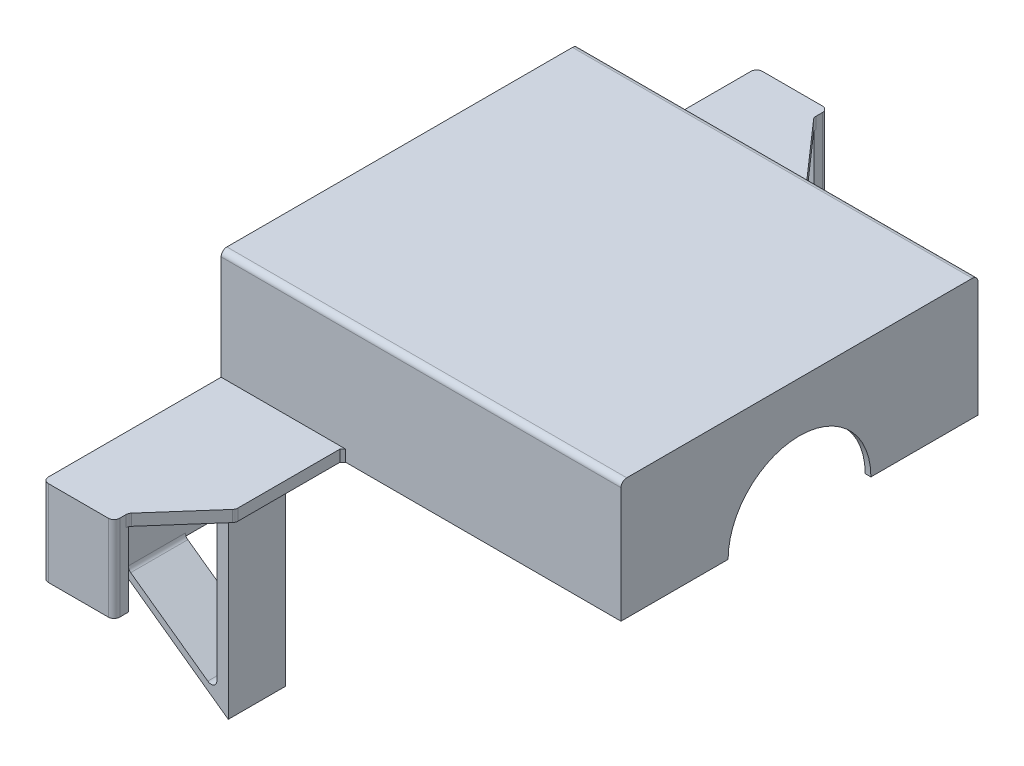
ISO-10303-21;
HEADER;
FILE_DESCRIPTION(('STEP AP214'),'2;1');
FILE_NAME('part.step','',(''),(''),'','','');
FILE_SCHEMA(('AUTOMOTIVE_DESIGN { 1 0 10303 214 1 1 1 1 }'));
ENDSEC;
DATA;
#1=APPLICATION_CONTEXT('core data for automotive mechanical design processes');
#2=APPLICATION_PROTOCOL_DEFINITION('international standard','automotive_design',2000,#1);
#3=PRODUCT_CONTEXT('',#1,'mechanical');
#4=PRODUCT('Part','Part','',(#3));
#5=PRODUCT_RELATED_PRODUCT_CATEGORY('part','',(#4));
#6=PRODUCT_DEFINITION_FORMATION('','',#4);
#7=PRODUCT_DEFINITION_CONTEXT('part definition',#1,'design');
#8=PRODUCT_DEFINITION('design','',#6,#7);
#9=PRODUCT_DEFINITION_SHAPE('','',#8);
#10=(LENGTH_UNIT() NAMED_UNIT(*) SI_UNIT(.MILLI.,.METRE.));
#11=(NAMED_UNIT(*) PLANE_ANGLE_UNIT() SI_UNIT($,.RADIAN.));
#12=(NAMED_UNIT(*) SI_UNIT($,.STERADIAN.) SOLID_ANGLE_UNIT());
#13=UNCERTAINTY_MEASURE_WITH_UNIT(LENGTH_MEASURE(1.E-05),#10,'distance_accuracy_value','');
#14=(GEOMETRIC_REPRESENTATION_CONTEXT(3) GLOBAL_UNCERTAINTY_ASSIGNED_CONTEXT((#13)) GLOBAL_UNIT_ASSIGNED_CONTEXT((#10,
#11,#12)) REPRESENTATION_CONTEXT('',''));
#15=CARTESIAN_POINT('',(0.,0.,0.));
#16=DIRECTION('',(0.,0.,1.));
#17=DIRECTION('',(1.,0.,0.));
#18=AXIS2_PLACEMENT_3D('',#15,#16,#17);
#19=CARTESIAN_POINT('',(0.,0.,0.));
#20=DIRECTION('',(0.,-1.,0.));
#21=DIRECTION('',(0.,0.,-1.));
#22=AXIS2_PLACEMENT_3D('',#19,#20,#21);
#23=PLANE('',#22);
#24=DIRECTION('',(1.,0.,0.));
#25=VECTOR('',#24,1.);
#26=CARTESIAN_POINT('',(-70.001,0.,-25.));
#27=LINE('',#26,#25);
#28=CARTESIAN_POINT('',(70.,0.,-25.));
#29=VERTEX_POINT('',#28);
#30=CARTESIAN_POINT('',(68.,0.,-25.));
#31=VERTEX_POINT('',#30);
#32=EDGE_CURVE('E404',#29,#31,#27,.F.);
#33=ORIENTED_EDGE('',*,*,#32,.T.);
#34=DIRECTION('',(0.,0.,-1.));
#35=VECTOR('',#34,1.);
#36=CARTESIAN_POINT('',(68.,0.,0.));
#37=LINE('',#36,#35);
#38=CARTESIAN_POINT('',(68.,0.,-60.5));
#39=VERTEX_POINT('',#38);
#40=EDGE_CURVE('E742',#31,#39,#37,.T.);
#41=ORIENTED_EDGE('',*,*,#40,.T.);
#42=DIRECTION('',(-1.,0.,0.));
#43=VECTOR('',#42,1.);
#44=CARTESIAN_POINT('',(0.,0.,-60.5));
#45=LINE('',#44,#43);
#46=CARTESIAN_POINT('',(-66.,0.,-60.5));
#47=VERTEX_POINT('',#46);
#48=EDGE_CURVE('E731',#39,#47,#45,.T.);
#49=ORIENTED_EDGE('',*,*,#48,.T.);
#50=DIRECTION('',(0.,0.,1.));
#51=VECTOR('',#50,1.);
#52=CARTESIAN_POINT('',(-66.,0.,0.));
#53=LINE('',#52,#51);
#54=CARTESIAN_POINT('',(-66.,0.,-99.0000000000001));
#55=VERTEX_POINT('',#54);
#56=EDGE_CURVE('E880',#55,#47,#53,.T.);
#57=ORIENTED_EDGE('',*,*,#56,.F.);
#58=DIRECTION('',(-1.,0.,0.));
#59=VECTOR('',#58,1.);
#60=CARTESIAN_POINT('',(-66.,0.,-99.0000000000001));
#61=LINE('',#60,#59);
#62=CARTESIAN_POINT('',(-70.,0.,-99.0000000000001));
#63=VERTEX_POINT('',#62);
#64=EDGE_CURVE('E657',#55,#63,#61,.T.);
#65=ORIENTED_EDGE('',*,*,#64,.T.);
#66=DIRECTION('',(0.,0.,1.));
#67=VECTOR('',#66,1.);
#68=CARTESIAN_POINT('',(-70.,0.,-62.5));
#69=LINE('',#68,#67);
#70=CARTESIAN_POINT('',(-70.,0.,-120.));
#71=VERTEX_POINT('',#70);
#72=EDGE_CURVE('E429',#71,#63,#69,.T.);
#73=ORIENTED_EDGE('',*,*,#72,.F.);
#74=DIRECTION('',(-1.,0.,0.));
#75=VECTOR('',#74,1.);
#76=CARTESIAN_POINT('',(-70.,0.,-120.));
#77=LINE('',#76,#75);
#78=CARTESIAN_POINT('',(-45.,0.,-120.));
#79=VERTEX_POINT('',#78);
#80=EDGE_CURVE('E677',#79,#71,#77,.T.);
#81=ORIENTED_EDGE('',*,*,#80,.F.);
#82=DIRECTION('',(0.,0.,1.));
#83=VECTOR('',#82,1.);
#84=CARTESIAN_POINT('',(-45.,0.,0.));
#85=LINE('',#84,#83);
#86=CARTESIAN_POINT('',(-45.,0.,-120.754695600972));
#87=VERTEX_POINT('',#86);
#88=EDGE_CURVE('E552',#87,#79,#85,.T.);
#89=ORIENTED_EDGE('',*,*,#88,.F.);
#90=CARTESIAN_POINT('',(-43.,0.,-120.754695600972));
#91=DIRECTION('',(0.,-1.,0.));
#92=DIRECTION('',(0.,0.,-1.));
#93=AXIS2_PLACEMENT_3D('',#90,#91,#92);
#94=CIRCLE('',#93,2.);
#95=CARTESIAN_POINT('',(-44.5014270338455,0.,-119.433439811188));
#96=VERTEX_POINT('',#95);
#97=EDGE_CURVE('E604',#87,#96,#94,.F.);
#98=ORIENTED_EDGE('',*,*,#97,.T.);
#99=DIRECTION('',(-0.660627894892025,0.,-0.750713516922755));
#100=VECTOR('',#99,1.);
#101=CARTESIAN_POINT('',(-45.,0.,-120.));
#102=LINE('',#101,#100);
#103=CARTESIAN_POINT('',(-27.8985729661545,0.,-100.566560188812));
#104=VERTEX_POINT('',#103);
#105=EDGE_CURVE('E693',#104,#96,#102,.T.);
#106=ORIENTED_EDGE('',*,*,#105,.F.);
#107=CARTESIAN_POINT('',(-29.4,0.,-99.2453043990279));
#108=DIRECTION('',(0.,-1.,0.));
#109=DIRECTION('',(0.,0.,-1.));
#110=AXIS2_PLACEMENT_3D('',#107,#108,#109);
#111=CIRCLE('',#110,2.);
#112=CARTESIAN_POINT('',(-27.4,0.,-99.2453043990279));
#113=VERTEX_POINT('',#112);
#114=EDGE_CURVE('E515',#104,#113,#111,.T.);
#115=ORIENTED_EDGE('',*,*,#114,.T.);
#116=DIRECTION('',(0.,0.,-1.));
#117=VECTOR('',#116,1.);
#118=CARTESIAN_POINT('',(-27.4,0.,-100.));
#119=LINE('',#118,#117);
#120=CARTESIAN_POINT('',(-27.4,0.,-63.5000000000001));
#121=VERTEX_POINT('',#120);
#122=EDGE_CURVE('E682',#121,#113,#119,.T.);
#123=ORIENTED_EDGE('',*,*,#122,.F.);
#124=DIRECTION('',(-0.70710678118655,0.,-0.707106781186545));
#125=VECTOR('',#124,1.);
#126=CARTESIAN_POINT('',(-27.4,0.,-63.5000000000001));
#127=LINE('',#126,#125);
#128=CARTESIAN_POINT('',(-26.3999999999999,0.,-62.5));
#129=VERTEX_POINT('',#128);
#130=EDGE_CURVE('E485',#121,#129,#127,.F.);
#131=ORIENTED_EDGE('',*,*,#130,.T.);
#132=DIRECTION('',(-1.,0.,0.));
#133=VECTOR('',#132,1.);
#134=CARTESIAN_POINT('',(70.,0.,-62.5));
#135=LINE('',#134,#133);
#136=CARTESIAN_POINT('',(70.,0.,-62.5));
#137=VERTEX_POINT('',#136);
#138=EDGE_CURVE('E425',#137,#129,#135,.T.);
#139=ORIENTED_EDGE('',*,*,#138,.F.);
#140=DIRECTION('',(0.,0.,-1.));
#141=VECTOR('',#140,1.);
#142=CARTESIAN_POINT('',(70.,0.,-62.5));
#143=LINE('',#142,#141);
#144=EDGE_CURVE('E417',#29,#137,#143,.T.);
#145=ORIENTED_EDGE('',*,*,#144,.F.);
#146=EDGE_LOOP('',(#33,#41,#49,#57,#65,#73,#81,#89,#98,#106,#115,#123,#131,#139,#145));
#147=FACE_BOUND('',#146,.T.);
#148=DIRECTION('',(-1.,0.,0.));
#149=VECTOR('',#148,1.);
#150=CARTESIAN_POINT('',(-31.,0.,-78.9999999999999));
#151=LINE('',#150,#149);
#152=CARTESIAN_POINT('',(-31.,0.,-78.9999999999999));
#153=VERTEX_POINT('',#152);
#154=CARTESIAN_POINT('',(-35.,0.,-78.9999999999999));
#155=VERTEX_POINT('',#154);
#156=EDGE_CURVE('E800',#153,#155,#151,.T.);
#157=ORIENTED_EDGE('',*,*,#156,.F.);
#158=DIRECTION('',(0.,0.,-1.));
#159=VECTOR('',#158,1.);
#160=CARTESIAN_POINT('',(-31.,0.,-78.9999999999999));
#161=LINE('',#160,#159);
#162=CARTESIAN_POINT('',(-31.,0.,-98.9999999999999));
#163=VERTEX_POINT('',#162);
#164=EDGE_CURVE('E821',#153,#163,#161,.T.);
#165=ORIENTED_EDGE('',*,*,#164,.T.);
#166=DIRECTION('',(-1.,0.,0.));
#167=VECTOR('',#166,1.);
#168=CARTESIAN_POINT('',(-31.,0.,-98.9999999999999));
#169=LINE('',#168,#167);
#170=CARTESIAN_POINT('',(-35.,0.,-98.9999999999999));
#171=VERTEX_POINT('',#170);
#172=EDGE_CURVE('E813',#163,#171,#169,.T.);
#173=ORIENTED_EDGE('',*,*,#172,.T.);
#174=DIRECTION('',(0.,0.,-1.));
#175=VECTOR('',#174,1.);
#176=CARTESIAN_POINT('',(-35.,0.,-78.9999999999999));
#177=LINE('',#176,#175);
#178=EDGE_CURVE('E824',#155,#171,#177,.T.);
#179=ORIENTED_EDGE('',*,*,#178,.F.);
#180=EDGE_LOOP('',(#157,#165,#173,#179));
#181=FACE_BOUND('',#180,.T.);
#182=ADVANCED_FACE('F36',(#147,#181),#23,.T.);
#183=CARTESIAN_POINT('',(70.,42.5,-62.5));
#184=DIRECTION('',(0.,0.,1.));
#185=DIRECTION('',(1.,0.,0.));
#186=AXIS2_PLACEMENT_3D('',#183,#184,#185);
#187=PLANE('',#186);
#188=DIRECTION('',(0.,-1.,0.));
#189=VECTOR('',#188,1.);
#190=CARTESIAN_POINT('',(-70.,42.5,-62.5));
#191=LINE('',#190,#189);
#192=CARTESIAN_POINT('',(-70.,40.5,-62.5));
#193=VERTEX_POINT('',#192);
#194=CARTESIAN_POINT('',(-70.,4.,-62.5));
#195=VERTEX_POINT('',#194);
#196=EDGE_CURVE('E435',#193,#195,#191,.T.);
#197=ORIENTED_EDGE('',*,*,#196,.F.);
#198=DIRECTION('',(-1.,0.,0.));
#199=VECTOR('',#198,1.);
#200=CARTESIAN_POINT('',(70.,40.5,-62.5));
#201=LINE('',#200,#199);
#202=CARTESIAN_POINT('',(70.,40.5,-62.5));
#203=VERTEX_POINT('',#202);
#204=EDGE_CURVE('E510',#193,#203,#201,.F.);
#205=ORIENTED_EDGE('',*,*,#204,.T.);
#206=DIRECTION('',(0.,-1.,0.));
#207=VECTOR('',#206,1.);
#208=CARTESIAN_POINT('',(70.,42.5,-62.5));
#209=LINE('',#208,#207);
#210=EDGE_CURVE('E438',#203,#137,#209,.T.);
#211=ORIENTED_EDGE('',*,*,#210,.T.);
#212=ORIENTED_EDGE('',*,*,#138,.T.);
#213=DIRECTION('',(0.,1.,0.));
#214=VECTOR('',#213,1.);
#215=CARTESIAN_POINT('',(-26.3999999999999,4.,-62.5));
#216=LINE('',#215,#214);
#217=CARTESIAN_POINT('',(-26.3999999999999,4.,-62.5));
#218=VERTEX_POINT('',#217);
#219=EDGE_CURVE('E450',#129,#218,#216,.T.);
#220=ORIENTED_EDGE('',*,*,#219,.T.);
#221=DIRECTION('',(1.,0.,0.));
#222=VECTOR('',#221,1.);
#223=CARTESIAN_POINT('',(-27.4,4.,-62.5));
#224=LINE('',#223,#222);
#225=EDGE_CURVE('E679',#195,#218,#224,.T.);
#226=ORIENTED_EDGE('',*,*,#225,.F.);
#227=EDGE_LOOP('',(#197,#205,#211,#212,#220,#226));
#228=FACE_BOUND('',#227,.T.);
#229=ADVANCED_FACE('F980',(#228),#187,.F.);
#230=DIRECTION('',(1.,0.,0.));
#231=VECTOR('',#230,1.);
#232=CARTESIAN_POINT('',(-70.001,0.,25.));
#233=LINE('',#232,#231);
#234=CARTESIAN_POINT('',(68.,0.,25.));
#235=VERTEX_POINT('',#234);
#236=CARTESIAN_POINT('',(70.,0.,25.));
#237=VERTEX_POINT('',#236);
#238=EDGE_CURVE('E51',#235,#237,#233,.T.);
#239=ORIENTED_EDGE('',*,*,#238,.T.);
#240=CARTESIAN_POINT('',(70.,0.,62.5));
#241=VERTEX_POINT('',#240);
#242=EDGE_CURVE('E420',#241,#237,#143,.T.);
#243=ORIENTED_EDGE('',*,*,#242,.F.);
#244=DIRECTION('',(1.,0.,0.));
#245=VECTOR('',#244,1.);
#246=CARTESIAN_POINT('',(70.,0.,62.5));
#247=LINE('',#246,#245);
#248=CARTESIAN_POINT('',(-26.4,0.,62.5));
#249=VERTEX_POINT('',#248);
#250=EDGE_CURVE('E426',#249,#241,#247,.T.);
#251=ORIENTED_EDGE('',*,*,#250,.F.);
#252=DIRECTION('',(-0.707106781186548,0.,0.707106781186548));
#253=VECTOR('',#252,1.);
#254=CARTESIAN_POINT('',(-26.4,0.,62.5));
#255=LINE('',#254,#253);
#256=CARTESIAN_POINT('',(-27.4,0.,63.5000000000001));
#257=VERTEX_POINT('',#256);
#258=EDGE_CURVE('E489',#249,#257,#255,.T.);
#259=ORIENTED_EDGE('',*,*,#258,.T.);
#260=DIRECTION('',(0.,0.,1.));
#261=VECTOR('',#260,1.);
#262=CARTESIAN_POINT('',(-27.4,0.,100.));
#263=LINE('',#262,#261);
#264=CARTESIAN_POINT('',(-27.4,0.,99.2453043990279));
#265=VERTEX_POINT('',#264);
#266=EDGE_CURVE('E690',#257,#265,#263,.T.);
#267=ORIENTED_EDGE('',*,*,#266,.T.);
#268=CARTESIAN_POINT('',(-29.4,0.,99.2453043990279));
#269=DIRECTION('',(0.,-1.,0.));
#270=DIRECTION('',(0.,0.,-1.));
#271=AXIS2_PLACEMENT_3D('',#268,#269,#270);
#272=CIRCLE('',#271,2.);
#273=CARTESIAN_POINT('',(-27.8985729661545,0.,100.566560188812));
#274=VERTEX_POINT('',#273);
#275=EDGE_CURVE('E517',#265,#274,#272,.T.);
#276=ORIENTED_EDGE('',*,*,#275,.T.);
#277=DIRECTION('',(-0.660627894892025,0.,0.750713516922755));
#278=VECTOR('',#277,1.);
#279=CARTESIAN_POINT('',(-45.,0.,120.));
#280=LINE('',#279,#278);
#281=CARTESIAN_POINT('',(-44.5014270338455,0.,119.433439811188));
#282=VERTEX_POINT('',#281);
#283=EDGE_CURVE('E712',#274,#282,#280,.T.);
#284=ORIENTED_EDGE('',*,*,#283,.T.);
#285=CARTESIAN_POINT('',(-43.,0.,120.754695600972));
#286=DIRECTION('',(0.,-1.,0.));
#287=DIRECTION('',(0.,0.,-1.));
#288=AXIS2_PLACEMENT_3D('',#285,#286,#287);
#289=CIRCLE('',#288,2.);
#290=CARTESIAN_POINT('',(-45.,0.,120.754695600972));
#291=VERTEX_POINT('',#290);
#292=EDGE_CURVE('E608',#282,#291,#289,.F.);
#293=ORIENTED_EDGE('',*,*,#292,.T.);
#294=DIRECTION('',(0.,0.,1.));
#295=VECTOR('',#294,1.);
#296=CARTESIAN_POINT('',(-45.,0.,0.));
#297=LINE('',#296,#295);
#298=CARTESIAN_POINT('',(-45.,0.,120.));
#299=VERTEX_POINT('',#298);
#300=EDGE_CURVE('E575',#299,#291,#297,.T.);
#301=ORIENTED_EDGE('',*,*,#300,.F.);
#302=DIRECTION('',(-1.,0.,0.));
#303=VECTOR('',#302,1.);
#304=CARTESIAN_POINT('',(-70.,0.,120.));
#305=LINE('',#304,#303);
#306=CARTESIAN_POINT('',(-70.,0.,120.));
#307=VERTEX_POINT('',#306);
#308=EDGE_CURVE('E701',#299,#307,#305,.T.);
#309=ORIENTED_EDGE('',*,*,#308,.T.);
#310=CARTESIAN_POINT('',(-70.,0.,98.9999999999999));
#311=VERTEX_POINT('',#310);
#312=EDGE_CURVE('E720',#311,#307,#69,.T.);
#313=ORIENTED_EDGE('',*,*,#312,.F.);
#314=DIRECTION('',(-1.,0.,0.));
#315=VECTOR('',#314,1.);
#316=CARTESIAN_POINT('',(-66.,0.,98.9999999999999));
#317=LINE('',#316,#315);
#318=CARTESIAN_POINT('',(-66.,0.,98.9999999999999));
#319=VERTEX_POINT('',#318);
#320=EDGE_CURVE('E661',#319,#311,#317,.T.);
#321=ORIENTED_EDGE('',*,*,#320,.F.);
#322=CARTESIAN_POINT('',(-66.,0.,60.5));
#323=VERTEX_POINT('',#322);
#324=EDGE_CURVE('E446',#323,#319,#53,.T.);
#325=ORIENTED_EDGE('',*,*,#324,.F.);
#326=DIRECTION('',(1.,0.,0.));
#327=VECTOR('',#326,1.);
#328=CARTESIAN_POINT('',(0.,0.,60.5));
#329=LINE('',#328,#327);
#330=CARTESIAN_POINT('',(68.,0.,60.5));
#331=VERTEX_POINT('',#330);
#332=EDGE_CURVE('E709',#323,#331,#329,.T.);
#333=ORIENTED_EDGE('',*,*,#332,.T.);
#334=EDGE_CURVE('E739',#331,#235,#37,.T.);
#335=ORIENTED_EDGE('',*,*,#334,.T.);
#336=EDGE_LOOP('',(#239,#243,#251,#259,#267,#276,#284,#293,#301,#309,#313,#321,#325,#333,#335));
#337=FACE_BOUND('',#336,.T.);
#338=DIRECTION('',(-1.,0.,0.));
#339=VECTOR('',#338,1.);
#340=CARTESIAN_POINT('',(-31.,0.,78.9999999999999));
#341=LINE('',#340,#339);
#342=CARTESIAN_POINT('',(-31.,0.,78.9999999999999));
#343=VERTEX_POINT('',#342);
#344=CARTESIAN_POINT('',(-35.,0.,78.9999999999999));
#345=VERTEX_POINT('',#344);
#346=EDGE_CURVE('E854',#343,#345,#341,.T.);
#347=ORIENTED_EDGE('',*,*,#346,.T.);
#348=DIRECTION('',(0.,0.,1.));
#349=VECTOR('',#348,1.);
#350=CARTESIAN_POINT('',(-35.,0.,78.9999999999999));
#351=LINE('',#350,#349);
#352=CARTESIAN_POINT('',(-35.,0.,98.9999999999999));
#353=VERTEX_POINT('',#352);
#354=EDGE_CURVE('E671',#345,#353,#351,.T.);
#355=ORIENTED_EDGE('',*,*,#354,.T.);
#356=DIRECTION('',(-1.,0.,0.));
#357=VECTOR('',#356,1.);
#358=CARTESIAN_POINT('',(-31.,0.,98.9999999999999));
#359=LINE('',#358,#357);
#360=CARTESIAN_POINT('',(-31.,0.,98.9999999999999));
#361=VERTEX_POINT('',#360);
#362=EDGE_CURVE('E866',#361,#353,#359,.T.);
#363=ORIENTED_EDGE('',*,*,#362,.F.);
#364=DIRECTION('',(0.,0.,1.));
#365=VECTOR('',#364,1.);
#366=CARTESIAN_POINT('',(-31.,0.,78.9999999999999));
#367=LINE('',#366,#365);
#368=EDGE_CURVE('E875',#343,#361,#367,.T.);
#369=ORIENTED_EDGE('',*,*,#368,.F.);
#370=EDGE_LOOP('',(#347,#355,#363,#369));
#371=FACE_BOUND('',#370,.T.);
#372=ADVANCED_FACE('F761',(#337,#371),#23,.T.);
#373=CARTESIAN_POINT('',(-70.,42.5,-62.5));
#374=DIRECTION('',(1.,0.,0.));
#375=DIRECTION('',(0.,0.,-1.));
#376=AXIS2_PLACEMENT_3D('',#373,#374,#375);
#377=PLANE('',#376);
#378=DIRECTION('',(0.,0.,1.));
#379=VECTOR('',#378,1.);
#380=CARTESIAN_POINT('',(-70.,4.,-62.5));
#381=LINE('',#380,#379);
#382=CARTESIAN_POINT('',(-70.,4.,-123.));
#383=VERTEX_POINT('',#382);
#384=EDGE_CURVE('E681',#383,#195,#381,.T.);
#385=ORIENTED_EDGE('',*,*,#384,.F.);
#386=DIRECTION('',(0.,-1.,0.));
#387=VECTOR('',#386,1.);
#388=CARTESIAN_POINT('',(-70.,-26.,-123.));
#389=LINE('',#388,#387);
#390=CARTESIAN_POINT('',(-70.,-26.,-123.));
#391=VERTEX_POINT('',#390);
#392=EDGE_CURVE('E561',#383,#391,#389,.T.);
#393=ORIENTED_EDGE('',*,*,#392,.T.);
#394=DIRECTION('',(0.,0.,1.));
#395=VECTOR('',#394,1.);
#396=CARTESIAN_POINT('',(-70.,-26.,-120.));
#397=LINE('',#396,#395);
#398=CARTESIAN_POINT('',(-70.,-26.,-120.));
#399=VERTEX_POINT('',#398);
#400=EDGE_CURVE('E820',#391,#399,#397,.T.);
#401=ORIENTED_EDGE('',*,*,#400,.T.);
#402=DIRECTION('',(0.,1.,0.));
#403=VECTOR('',#402,1.);
#404=CARTESIAN_POINT('',(-70.,4.,-120.));
#405=LINE('',#404,#403);
#406=EDGE_CURVE('E832',#399,#71,#405,.T.);
#407=ORIENTED_EDGE('',*,*,#406,.T.);
#408=ORIENTED_EDGE('',*,*,#72,.T.);
#409=DIRECTION('',(0.,-1.,0.));
#410=VECTOR('',#409,1.);
#411=CARTESIAN_POINT('',(-70.,0.,-99.0000000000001));
#412=LINE('',#411,#410);
#413=CARTESIAN_POINT('',(-70.,-34.,-98.9999999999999));
#414=VERTEX_POINT('',#413);
#415=EDGE_CURVE('E667',#63,#414,#412,.T.);
#416=ORIENTED_EDGE('',*,*,#415,.T.);
#417=DIRECTION('',(0.,0.,-1.));
#418=VECTOR('',#417,1.);
#419=CARTESIAN_POINT('',(-70.,-34.,-78.9999999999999));
#420=LINE('',#419,#418);
#421=CARTESIAN_POINT('',(-70.,-34.,-78.9999999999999));
#422=VERTEX_POINT('',#421);
#423=EDGE_CURVE('E804',#422,#414,#420,.T.);
#424=ORIENTED_EDGE('',*,*,#423,.F.);
#425=DIRECTION('',(0.,0.,-1.));
#426=VECTOR('',#425,1.);
#427=CARTESIAN_POINT('',(-70.,-34.,0.));
#428=LINE('',#427,#426);
#429=CARTESIAN_POINT('',(-70.,-34.,78.9999999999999));
#430=VERTEX_POINT('',#429);
#431=EDGE_CURVE('E670',#430,#422,#428,.T.);
#432=ORIENTED_EDGE('',*,*,#431,.F.);
#433=CARTESIAN_POINT('',(-70.,-34.,98.9999999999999));
#434=VERTEX_POINT('',#433);
#435=EDGE_CURVE('E672',#434,#430,#428,.T.);
#436=ORIENTED_EDGE('',*,*,#435,.F.);
#437=DIRECTION('',(0.,-1.,0.));
#438=VECTOR('',#437,1.);
#439=CARTESIAN_POINT('',(-70.,0.,98.9999999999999));
#440=LINE('',#439,#438);
#441=EDGE_CURVE('E674',#311,#434,#440,.T.);
#442=ORIENTED_EDGE('',*,*,#441,.F.);
#443=ORIENTED_EDGE('',*,*,#312,.T.);
#444=DIRECTION('',(0.,1.,0.));
#445=VECTOR('',#444,1.);
#446=CARTESIAN_POINT('',(-70.,4.,120.));
#447=LINE('',#446,#445);
#448=CARTESIAN_POINT('',(-70.,-26.,120.));
#449=VERTEX_POINT('',#448);
#450=EDGE_CURVE('E757',#449,#307,#447,.T.);
#451=ORIENTED_EDGE('',*,*,#450,.F.);
#452=DIRECTION('',(0.,0.,-1.));
#453=VECTOR('',#452,1.);
#454=CARTESIAN_POINT('',(-70.,-26.,120.));
#455=LINE('',#454,#453);
#456=CARTESIAN_POINT('',(-70.,-26.,123.));
#457=VERTEX_POINT('',#456);
#458=EDGE_CURVE('E771',#457,#449,#455,.T.);
#459=ORIENTED_EDGE('',*,*,#458,.F.);
#460=DIRECTION('',(0.,-1.,0.));
#461=VECTOR('',#460,1.);
#462=CARTESIAN_POINT('',(-70.,42.5,123.));
#463=LINE('',#462,#461);
#464=CARTESIAN_POINT('',(-70.,4.,123.));
#465=VERTEX_POINT('',#464);
#466=EDGE_CURVE('E559',#457,#465,#463,.F.);
#467=ORIENTED_EDGE('',*,*,#466,.T.);
#468=DIRECTION('',(0.,0.,-1.));
#469=VECTOR('',#468,1.);
#470=CARTESIAN_POINT('',(-70.,4.,62.5));
#471=LINE('',#470,#469);
#472=CARTESIAN_POINT('',(-70.,4.,62.5));
#473=VERTEX_POINT('',#472);
#474=EDGE_CURVE('E707',#465,#473,#471,.T.);
#475=ORIENTED_EDGE('',*,*,#474,.T.);
#476=DIRECTION('',(0.,-1.,0.));
#477=VECTOR('',#476,1.);
#478=CARTESIAN_POINT('',(-70.,42.5,62.5));
#479=LINE('',#478,#477);
#480=CARTESIAN_POINT('',(-70.,40.5,62.5));
#481=VERTEX_POINT('',#480);
#482=EDGE_CURVE('E443',#481,#473,#479,.T.);
#483=ORIENTED_EDGE('',*,*,#482,.F.);
#484=CARTESIAN_POINT('',(-70.,40.5,60.5));
#485=DIRECTION('',(1.,0.,0.));
#486=DIRECTION('',(0.,0.,-1.));
#487=AXIS2_PLACEMENT_3D('',#484,#485,#486);
#488=CIRCLE('',#487,2.);
#489=CARTESIAN_POINT('',(-70.,42.5,60.5));
#490=VERTEX_POINT('',#489);
#491=EDGE_CURVE('E508',#481,#490,#488,.F.);
#492=ORIENTED_EDGE('',*,*,#491,.T.);
#493=DIRECTION('',(0.,0.,1.));
#494=VECTOR('',#493,1.);
#495=CARTESIAN_POINT('',(-70.,42.5,-62.5));
#496=LINE('',#495,#494);
#497=CARTESIAN_POINT('',(-70.,42.5,-60.5));
#498=VERTEX_POINT('',#497);
#499=EDGE_CURVE('E434',#498,#490,#496,.T.);
#500=ORIENTED_EDGE('',*,*,#499,.F.);
#501=CARTESIAN_POINT('',(-70.,40.5,-60.5));
#502=DIRECTION('',(1.,0.,0.));
#503=DIRECTION('',(0.,0.,-1.));
#504=AXIS2_PLACEMENT_3D('',#501,#502,#503);
#505=CIRCLE('',#504,2.);
#506=EDGE_CURVE('E506',#498,#193,#505,.F.);
#507=ORIENTED_EDGE('',*,*,#506,.T.);
#508=ORIENTED_EDGE('',*,*,#196,.T.);
#509=EDGE_LOOP('',(#385,#393,#401,#407,#408,#416,#424,#432,#436,#442,#443,#451,#459,#467,#475,
#483,#492,#500,#507,#508));
#510=FACE_BOUND('',#509,.T.);
#511=ADVANCED_FACE('F755',(#510),#377,.F.);
#512=CARTESIAN_POINT('',(70.,42.5,62.5));
#513=DIRECTION('',(0.,0.,-1.));
#514=DIRECTION('',(-1.,0.,0.));
#515=AXIS2_PLACEMENT_3D('',#512,#513,#514);
#516=PLANE('',#515);
#517=DIRECTION('',(0.,-1.,0.));
#518=VECTOR('',#517,1.);
#519=CARTESIAN_POINT('',(70.,42.5,62.5));
#520=LINE('',#519,#518);
#521=CARTESIAN_POINT('',(70.,40.5,62.5));
#522=VERTEX_POINT('',#521);
#523=EDGE_CURVE('E441',#522,#241,#520,.T.);
#524=ORIENTED_EDGE('',*,*,#523,.F.);
#525=DIRECTION('',(1.,0.,0.));
#526=VECTOR('',#525,1.);
#527=CARTESIAN_POINT('',(70.,40.5,62.5));
#528=LINE('',#527,#526);
#529=EDGE_CURVE('E504',#522,#481,#528,.F.);
#530=ORIENTED_EDGE('',*,*,#529,.T.);
#531=ORIENTED_EDGE('',*,*,#482,.T.);
#532=DIRECTION('',(1.,0.,0.));
#533=VECTOR('',#532,1.);
#534=CARTESIAN_POINT('',(-27.4,4.,62.5));
#535=LINE('',#534,#533);
#536=CARTESIAN_POINT('',(-26.4,4.,62.5));
#537=VERTEX_POINT('',#536);
#538=EDGE_CURVE('E698',#473,#537,#535,.T.);
#539=ORIENTED_EDGE('',*,*,#538,.T.);
#540=DIRECTION('',(0.,-1.,0.));
#541=VECTOR('',#540,1.);
#542=CARTESIAN_POINT('',(-26.4,42.5,62.5));
#543=LINE('',#542,#541);
#544=EDGE_CURVE('E453',#537,#249,#543,.T.);
#545=ORIENTED_EDGE('',*,*,#544,.T.);
#546=ORIENTED_EDGE('',*,*,#250,.T.);
#547=EDGE_LOOP('',(#524,#530,#531,#539,#545,#546));
#548=FACE_BOUND('',#547,.T.);
#549=ADVANCED_FACE('F992',(#548),#516,.F.);
#550=CARTESIAN_POINT('',(70.,42.5,-62.5));
#551=DIRECTION('',(-1.,0.,0.));
#552=DIRECTION('',(0.,0.,1.));
#553=AXIS2_PLACEMENT_3D('',#550,#551,#552);
#554=PLANE('',#553);
#555=ORIENTED_EDGE('',*,*,#242,.T.);
#556=CARTESIAN_POINT('',(70.,0.,0.));
#557=DIRECTION('',(1.,0.,0.));
#558=DIRECTION('',(0.,0.,-1.));
#559=AXIS2_PLACEMENT_3D('',#556,#557,#558);
#560=CIRCLE('',#559,25.);
#561=EDGE_CURVE('E407',#29,#237,#560,.T.);
#562=ORIENTED_EDGE('',*,*,#561,.F.);
#563=ORIENTED_EDGE('',*,*,#144,.T.);
#564=ORIENTED_EDGE('',*,*,#210,.F.);
#565=CARTESIAN_POINT('',(70.,40.5,-60.5));
#566=DIRECTION('',(-1.,0.,0.));
#567=DIRECTION('',(0.,0.,1.));
#568=AXIS2_PLACEMENT_3D('',#565,#566,#567);
#569=CIRCLE('',#568,2.);
#570=CARTESIAN_POINT('',(70.,42.5,-60.5));
#571=VERTEX_POINT('',#570);
#572=EDGE_CURVE('E500',#203,#571,#569,.F.);
#573=ORIENTED_EDGE('',*,*,#572,.T.);
#574=DIRECTION('',(0.,0.,-1.));
#575=VECTOR('',#574,1.);
#576=CARTESIAN_POINT('',(70.,42.5,-62.5));
#577=LINE('',#576,#575);
#578=CARTESIAN_POINT('',(70.,42.5,60.5));
#579=VERTEX_POINT('',#578);
#580=EDGE_CURVE('E439',#579,#571,#577,.T.);
#581=ORIENTED_EDGE('',*,*,#580,.F.);
#582=CARTESIAN_POINT('',(70.,40.5,60.5));
#583=DIRECTION('',(-1.,0.,0.));
#584=DIRECTION('',(0.,0.,1.));
#585=AXIS2_PLACEMENT_3D('',#582,#583,#584);
#586=CIRCLE('',#585,2.);
#587=EDGE_CURVE('E502',#579,#522,#586,.F.);
#588=ORIENTED_EDGE('',*,*,#587,.T.);
#589=ORIENTED_EDGE('',*,*,#523,.T.);
#590=EDGE_LOOP('',(#555,#562,#563,#564,#573,#581,#588,#589));
#591=FACE_BOUND('',#590,.T.);
#592=ADVANCED_FACE('F415',(#591),#554,.F.);
#593=CARTESIAN_POINT('',(0.,42.5,0.));
#594=DIRECTION('',(0.,-1.,0.));
#595=DIRECTION('',(0.,0.,-1.));
#596=AXIS2_PLACEMENT_3D('',#593,#594,#595);
#597=PLANE('',#596);
#598=ORIENTED_EDGE('',*,*,#499,.T.);
#599=DIRECTION('',(1.,0.,0.));
#600=VECTOR('',#599,1.);
#601=CARTESIAN_POINT('',(0.,42.5,60.5));
#602=LINE('',#601,#600);
#603=EDGE_CURVE('E497',#490,#579,#602,.T.);
#604=ORIENTED_EDGE('',*,*,#603,.T.);
#605=ORIENTED_EDGE('',*,*,#580,.T.);
#606=DIRECTION('',(-1.,0.,0.));
#607=VECTOR('',#606,1.);
#608=CARTESIAN_POINT('',(0.,42.5,-60.5));
#609=LINE('',#608,#607);
#610=EDGE_CURVE('E494',#571,#498,#609,.T.);
#611=ORIENTED_EDGE('',*,*,#610,.T.);
#612=EDGE_LOOP('',(#598,#604,#605,#611));
#613=FACE_BOUND('',#612,.T.);
#614=ADVANCED_FACE('F1122',(#613),#597,.F.);
#615=CARTESIAN_POINT('',(-68.,42.5,-62.5));
#616=DIRECTION('',(1.,0.,0.));
#617=DIRECTION('',(0.,0.,-1.));
#618=AXIS2_PLACEMENT_3D('',#615,#616,#617);
#619=PLANE('',#618);
#620=DIRECTION('',(0.,-1.,0.));
#621=VECTOR('',#620,1.);
#622=CARTESIAN_POINT('',(-68.,42.5,-60.5));
#623=LINE('',#622,#621);
#624=CARTESIAN_POINT('',(-68.,39.5,-60.5));
#625=VERTEX_POINT('',#624);
#626=CARTESIAN_POINT('',(-68.,1.,-60.5));
#627=VERTEX_POINT('',#626);
#628=EDGE_CURVE('E722',#625,#627,#623,.T.);
#629=ORIENTED_EDGE('',*,*,#628,.F.);
#630=DIRECTION('',(0.,0.,1.));
#631=VECTOR('',#630,1.);
#632=CARTESIAN_POINT('',(-68.,39.5,60.5));
#633=LINE('',#632,#631);
#634=CARTESIAN_POINT('',(-68.,39.5,60.5));
#635=VERTEX_POINT('',#634);
#636=EDGE_CURVE('E479',#625,#635,#633,.T.);
#637=ORIENTED_EDGE('',*,*,#636,.T.);
#638=DIRECTION('',(0.,-1.,0.));
#639=VECTOR('',#638,1.);
#640=CARTESIAN_POINT('',(-68.,42.5,60.5));
#641=LINE('',#640,#639);
#642=CARTESIAN_POINT('',(-68.,1.,60.5));
#643=VERTEX_POINT('',#642);
#644=EDGE_CURVE('E717',#635,#643,#641,.T.);
#645=ORIENTED_EDGE('',*,*,#644,.T.);
#646=DIRECTION('',(0.,0.,-1.));
#647=VECTOR('',#646,1.);
#648=CARTESIAN_POINT('',(-68.,1.,-62.5));
#649=LINE('',#648,#647);
#650=EDGE_CURVE('E477',#643,#627,#649,.T.);
#651=ORIENTED_EDGE('',*,*,#650,.T.);
#652=EDGE_LOOP('',(#629,#637,#645,#651));
#653=FACE_BOUND('',#652,.T.);
#654=ADVANCED_FACE('F909',(#653),#619,.T.);
#655=CARTESIAN_POINT('',(70.,42.5,60.5));
#656=DIRECTION('',(0.,0.,-1.));
#657=DIRECTION('',(-1.,0.,0.));
#658=AXIS2_PLACEMENT_3D('',#655,#656,#657);
#659=PLANE('',#658);
#660=DIRECTION('',(1.,0.,0.));
#661=VECTOR('',#660,1.);
#662=CARTESIAN_POINT('',(0.,40.5,60.5));
#663=LINE('',#662,#661);
#664=CARTESIAN_POINT('',(-67.,40.5,60.5));
#665=VERTEX_POINT('',#664);
#666=CARTESIAN_POINT('',(67.,40.5,60.5));
#667=VERTEX_POINT('',#666);
#668=EDGE_CURVE('E728',#665,#667,#663,.T.);
#669=ORIENTED_EDGE('',*,*,#668,.T.);
#670=DIRECTION('',(-0.707106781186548,0.707106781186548,0.));
#671=VECTOR('',#670,1.);
#672=CARTESIAN_POINT('',(67.5,40.,60.5));
#673=LINE('',#672,#671);
#674=CARTESIAN_POINT('',(68.,39.5,60.5));
#675=VERTEX_POINT('',#674);
#676=EDGE_CURVE('E475',#667,#675,#673,.F.);
#677=ORIENTED_EDGE('',*,*,#676,.T.);
#678=DIRECTION('',(0.,-1.,0.));
#679=VECTOR('',#678,1.);
#680=CARTESIAN_POINT('',(68.,42.5,60.5));
#681=LINE('',#680,#679);
#682=EDGE_CURVE('E721',#675,#331,#681,.T.);
#683=ORIENTED_EDGE('',*,*,#682,.T.);
#684=ORIENTED_EDGE('',*,*,#332,.F.);
#685=CARTESIAN_POINT('',(-67.,0.,60.5));
#686=VERTEX_POINT('',#685);
#687=EDGE_CURVE('E743',#686,#323,#329,.T.);
#688=ORIENTED_EDGE('',*,*,#687,.F.);
#689=DIRECTION('',(-0.707106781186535,0.70710678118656,0.));
#690=VECTOR('',#689,1.);
#691=CARTESIAN_POINT('',(-19.7500000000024,-47.2499999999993,60.5));
#692=LINE('',#691,#690);
#693=EDGE_CURVE('E471',#686,#643,#692,.T.);
#694=ORIENTED_EDGE('',*,*,#693,.T.);
#695=ORIENTED_EDGE('',*,*,#644,.F.);
#696=DIRECTION('',(-0.707106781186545,-0.70710678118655,0.));
#697=VECTOR('',#696,1.);
#698=CARTESIAN_POINT('',(2.49999999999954,110.,60.5));
#699=LINE('',#698,#697);
#700=EDGE_CURVE('E473',#635,#665,#699,.F.);
#701=ORIENTED_EDGE('',*,*,#700,.T.);
#702=EDGE_LOOP('',(#669,#677,#683,#684,#688,#694,#695,#701));
#703=FACE_BOUND('',#702,.T.);
#704=ADVANCED_FACE('F905',(#703),#659,.T.);
#705=CARTESIAN_POINT('',(68.,42.5,-62.5));
#706=DIRECTION('',(-1.,0.,0.));
#707=DIRECTION('',(0.,0.,1.));
#708=AXIS2_PLACEMENT_3D('',#705,#706,#707);
#709=PLANE('',#708);
#710=CARTESIAN_POINT('',(68.,0.,0.));
#711=DIRECTION('',(-1.,0.,0.));
#712=DIRECTION('',(0.,0.,1.));
#713=AXIS2_PLACEMENT_3D('',#710,#711,#712);
#714=CIRCLE('',#713,25.);
#715=EDGE_CURVE('E408',#31,#235,#714,.F.);
#716=ORIENTED_EDGE('',*,*,#715,.T.);
#717=ORIENTED_EDGE('',*,*,#334,.F.);
#718=ORIENTED_EDGE('',*,*,#682,.F.);
#719=DIRECTION('',(0.,0.,-1.));
#720=VECTOR('',#719,1.);
#721=CARTESIAN_POINT('',(68.,39.5,-60.5));
#722=LINE('',#721,#720);
#723=CARTESIAN_POINT('',(68.,39.5,-60.5));
#724=VERTEX_POINT('',#723);
#725=EDGE_CURVE('E458',#675,#724,#722,.T.);
#726=ORIENTED_EDGE('',*,*,#725,.T.);
#727=DIRECTION('',(0.,-1.,0.));
#728=VECTOR('',#727,1.);
#729=CARTESIAN_POINT('',(68.,42.5,-60.5));
#730=LINE('',#729,#728);
#731=EDGE_CURVE('E725',#724,#39,#730,.T.);
#732=ORIENTED_EDGE('',*,*,#731,.T.);
#733=ORIENTED_EDGE('',*,*,#40,.F.);
#734=EDGE_LOOP('',(#716,#717,#718,#726,#732,#733));
#735=FACE_BOUND('',#734,.T.);
#736=ADVANCED_FACE('F928',(#735),#709,.T.);
#737=CARTESIAN_POINT('',(70.,42.5,-60.5));
#738=DIRECTION('',(0.,0.,1.));
#739=DIRECTION('',(1.,0.,0.));
#740=AXIS2_PLACEMENT_3D('',#737,#738,#739);
#741=PLANE('',#740);
#742=ORIENTED_EDGE('',*,*,#731,.F.);
#743=DIRECTION('',(0.707106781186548,-0.707106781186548,0.));
#744=VECTOR('',#743,1.);
#745=CARTESIAN_POINT('',(67.5,40.,-60.5));
#746=LINE('',#745,#744);
#747=CARTESIAN_POINT('',(67.,40.5,-60.5));
#748=VERTEX_POINT('',#747);
#749=EDGE_CURVE('E465',#724,#748,#746,.F.);
#750=ORIENTED_EDGE('',*,*,#749,.T.);
#751=DIRECTION('',(-1.,0.,0.));
#752=VECTOR('',#751,1.);
#753=CARTESIAN_POINT('',(0.,40.5,-60.5));
#754=LINE('',#753,#752);
#755=CARTESIAN_POINT('',(-67.,40.5,-60.5));
#756=VERTEX_POINT('',#755);
#757=EDGE_CURVE('E726',#748,#756,#754,.T.);
#758=ORIENTED_EDGE('',*,*,#757,.T.);
#759=DIRECTION('',(0.707106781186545,0.70710678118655,0.));
#760=VECTOR('',#759,1.);
#761=CARTESIAN_POINT('',(2.49999999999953,110.,-60.5));
#762=LINE('',#761,#760);
#763=EDGE_CURVE('E463',#756,#625,#762,.F.);
#764=ORIENTED_EDGE('',*,*,#763,.T.);
#765=ORIENTED_EDGE('',*,*,#628,.T.);
#766=DIRECTION('',(0.707106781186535,-0.70710678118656,0.));
#767=VECTOR('',#766,1.);
#768=CARTESIAN_POINT('',(-19.7500000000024,-47.2499999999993,-60.5));
#769=LINE('',#768,#767);
#770=CARTESIAN_POINT('',(-67.,0.,-60.5));
#771=VERTEX_POINT('',#770);
#772=EDGE_CURVE('E461',#627,#771,#769,.T.);
#773=ORIENTED_EDGE('',*,*,#772,.T.);
#774=EDGE_CURVE('E738',#47,#771,#45,.T.);
#775=ORIENTED_EDGE('',*,*,#774,.F.);
#776=ORIENTED_EDGE('',*,*,#48,.F.);
#777=EDGE_LOOP('',(#742,#750,#758,#764,#765,#773,#775,#776));
#778=FACE_BOUND('',#777,.T.);
#779=ADVANCED_FACE('F893',(#778),#741,.T.);
#780=CARTESIAN_POINT('',(0.,40.5,0.));
#781=DIRECTION('',(0.,-1.,0.));
#782=DIRECTION('',(0.,0.,-1.));
#783=AXIS2_PLACEMENT_3D('',#780,#781,#782);
#784=PLANE('',#783);
#785=ORIENTED_EDGE('',*,*,#757,.F.);
#786=DIRECTION('',(0.,0.,1.));
#787=VECTOR('',#786,1.);
#788=CARTESIAN_POINT('',(67.,40.5,60.5));
#789=LINE('',#788,#787);
#790=EDGE_CURVE('E469',#748,#667,#789,.T.);
#791=ORIENTED_EDGE('',*,*,#790,.T.);
#792=ORIENTED_EDGE('',*,*,#668,.F.);
#793=DIRECTION('',(0.,0.,-1.));
#794=VECTOR('',#793,1.);
#795=CARTESIAN_POINT('',(-67.,40.5,-60.5));
#796=LINE('',#795,#794);
#797=EDGE_CURVE('E467',#665,#756,#796,.T.);
#798=ORIENTED_EDGE('',*,*,#797,.T.);
#799=EDGE_LOOP('',(#785,#791,#792,#798));
#800=FACE_BOUND('',#799,.T.);
#801=ADVANCED_FACE('F919',(#800),#784,.T.);
#802=CARTESIAN_POINT('',(-45.,4.,120.));
#803=DIRECTION('',(0.750713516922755,0.,0.660627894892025));
#804=DIRECTION('',(0.660627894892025,0.,-0.750713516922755));
#805=AXIS2_PLACEMENT_3D('',#802,#803,#804);
#806=PLANE('',#805);
#807=ORIENTED_EDGE('',*,*,#283,.F.);
#808=DIRECTION('',(0.,-1.,0.));
#809=VECTOR('',#808,1.);
#810=CARTESIAN_POINT('',(-27.8985729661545,4.,100.566560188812));
#811=LINE('',#810,#809);
#812=CARTESIAN_POINT('',(-27.8985729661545,4.,100.566560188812));
#813=VERTEX_POINT('',#812);
#814=EDGE_CURVE('E522',#274,#813,#811,.F.);
#815=ORIENTED_EDGE('',*,*,#814,.T.);
#816=DIRECTION('',(-0.660627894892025,0.,0.750713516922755));
#817=VECTOR('',#816,1.);
#818=CARTESIAN_POINT('',(-45.,4.,120.));
#819=LINE('',#818,#817);
#820=CARTESIAN_POINT('',(-44.5014270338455,4.,119.433439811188));
#821=VERTEX_POINT('',#820);
#822=EDGE_CURVE('E704',#813,#821,#819,.T.);
#823=ORIENTED_EDGE('',*,*,#822,.T.);
#824=DIRECTION('',(0.,-1.,0.));
#825=VECTOR('',#824,1.);
#826=CARTESIAN_POINT('',(-44.5014270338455,0.,119.433439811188));
#827=LINE('',#826,#825);
#828=EDGE_CURVE('E519',#821,#282,#827,.T.);
#829=ORIENTED_EDGE('',*,*,#828,.T.);
#830=EDGE_LOOP('',(#807,#815,#823,#829));
#831=FACE_BOUND('',#830,.T.);
#832=ADVANCED_FACE('F1113',(#831),#806,.T.);
#833=CARTESIAN_POINT('',(-27.4,4.,100.));
#834=DIRECTION('',(1.,0.,0.));
#835=DIRECTION('',(0.,0.,-1.));
#836=AXIS2_PLACEMENT_3D('',#833,#834,#835);
#837=PLANE('',#836);
#838=DIRECTION('',(0.,0.,1.));
#839=VECTOR('',#838,1.);
#840=CARTESIAN_POINT('',(-27.4,4.,100.));
#841=LINE('',#840,#839);
#842=CARTESIAN_POINT('',(-27.4,4.,63.5000000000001));
#843=VERTEX_POINT('',#842);
#844=CARTESIAN_POINT('',(-27.4,4.,99.2453043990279));
#845=VERTEX_POINT('',#844);
#846=EDGE_CURVE('E700',#843,#845,#841,.T.);
#847=ORIENTED_EDGE('',*,*,#846,.T.);
#848=DIRECTION('',(0.,-1.,0.));
#849=VECTOR('',#848,1.);
#850=CARTESIAN_POINT('',(-27.4,4.,99.2453043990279));
#851=LINE('',#850,#849);
#852=EDGE_CURVE('E512',#845,#265,#851,.T.);
#853=ORIENTED_EDGE('',*,*,#852,.T.);
#854=ORIENTED_EDGE('',*,*,#266,.F.);
#855=DIRECTION('',(0.,1.,0.));
#856=VECTOR('',#855,1.);
#857=CARTESIAN_POINT('',(-27.4,4.,63.5000000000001));
#858=LINE('',#857,#856);
#859=EDGE_CURVE('E456',#257,#843,#858,.T.);
#860=ORIENTED_EDGE('',*,*,#859,.T.);
#861=EDGE_LOOP('',(#847,#853,#854,#860));
#862=FACE_BOUND('',#861,.T.);
#863=ADVANCED_FACE('F1111',(#862),#837,.T.);
#864=CARTESIAN_POINT('',(0.,4.,0.));
#865=DIRECTION('',(0.,1.,0.));
#866=DIRECTION('',(0.,0.,1.));
#867=AXIS2_PLACEMENT_3D('',#864,#865,#866);
#868=PLANE('',#867);
#869=ORIENTED_EDGE('',*,*,#822,.F.);
#870=CARTESIAN_POINT('',(-29.4,4.,99.2453043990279));
#871=DIRECTION('',(0.,1.,0.));
#872=DIRECTION('',(0.,0.,1.));
#873=AXIS2_PLACEMENT_3D('',#870,#871,#872);
#874=CIRCLE('',#873,2.);
#875=EDGE_CURVE('E528',#813,#845,#874,.T.);
#876=ORIENTED_EDGE('',*,*,#875,.T.);
#877=ORIENTED_EDGE('',*,*,#846,.F.);
#878=DIRECTION('',(0.707106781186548,0.,-0.707106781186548));
#879=VECTOR('',#878,1.);
#880=CARTESIAN_POINT('',(-26.4,4.,62.5));
#881=LINE('',#880,#879);
#882=EDGE_CURVE('E491',#843,#537,#881,.T.);
#883=ORIENTED_EDGE('',*,*,#882,.T.);
#884=ORIENTED_EDGE('',*,*,#538,.F.);
#885=ORIENTED_EDGE('',*,*,#474,.F.);
#886=CARTESIAN_POINT('',(-68.,4.,123.));
#887=DIRECTION('',(0.,1.,0.));
#888=DIRECTION('',(0.,0.,1.));
#889=AXIS2_PLACEMENT_3D('',#886,#887,#888);
#890=CIRCLE('',#889,2.);
#891=CARTESIAN_POINT('',(-68.,4.,125.));
#892=VERTEX_POINT('',#891);
#893=EDGE_CURVE('E526',#465,#892,#890,.T.);
#894=ORIENTED_EDGE('',*,*,#893,.T.);
#895=DIRECTION('',(-1.,0.,0.));
#896=VECTOR('',#895,1.);
#897=CARTESIAN_POINT('',(-45.,4.,125.));
#898=LINE('',#897,#896);
#899=CARTESIAN_POINT('',(-47.,4.,125.));
#900=VERTEX_POINT('',#899);
#901=EDGE_CURVE('E780',#900,#892,#898,.T.);
#902=ORIENTED_EDGE('',*,*,#901,.F.);
#903=CARTESIAN_POINT('',(-47.,4.,123.));
#904=DIRECTION('',(0.,1.,0.));
#905=DIRECTION('',(0.,0.,1.));
#906=AXIS2_PLACEMENT_3D('',#903,#904,#905);
#907=CIRCLE('',#906,2.);
#908=CARTESIAN_POINT('',(-45.,4.,123.));
#909=VERTEX_POINT('',#908);
#910=EDGE_CURVE('E524',#900,#909,#907,.T.);
#911=ORIENTED_EDGE('',*,*,#910,.T.);
#912=DIRECTION('',(0.,0.,1.));
#913=VECTOR('',#912,1.);
#914=CARTESIAN_POINT('',(-45.,4.,125.));
#915=LINE('',#914,#913);
#916=CARTESIAN_POINT('',(-45.,4.,120.754695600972));
#917=VERTEX_POINT('',#916);
#918=EDGE_CURVE('E773',#917,#909,#915,.T.);
#919=ORIENTED_EDGE('',*,*,#918,.F.);
#920=CARTESIAN_POINT('',(-43.,4.,120.754695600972));
#921=DIRECTION('',(0.,1.,0.));
#922=DIRECTION('',(0.,0.,1.));
#923=AXIS2_PLACEMENT_3D('',#920,#921,#922);
#924=CIRCLE('',#923,2.);
#925=EDGE_CURVE('E610',#917,#821,#924,.F.);
#926=ORIENTED_EDGE('',*,*,#925,.T.);
#927=EDGE_LOOP('',(#869,#876,#877,#883,#884,#885,#894,#902,#911,#919,#926));
#928=FACE_BOUND('',#927,.T.);
#929=ADVANCED_FACE('F1104',(#928),#868,.T.);
#930=CARTESIAN_POINT('',(-27.4,4.,-100.));
#931=DIRECTION('',(-1.,0.,0.));
#932=DIRECTION('',(0.,0.,1.));
#933=AXIS2_PLACEMENT_3D('',#930,#931,#932);
#934=PLANE('',#933);
#935=ORIENTED_EDGE('',*,*,#122,.T.);
#936=DIRECTION('',(0.,-1.,0.));
#937=VECTOR('',#936,1.);
#938=CARTESIAN_POINT('',(-27.4,4.,-99.2453043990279));
#939=LINE('',#938,#937);
#940=CARTESIAN_POINT('',(-27.4,4.,-99.2453043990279));
#941=VERTEX_POINT('',#940);
#942=EDGE_CURVE('E535',#113,#941,#939,.F.);
#943=ORIENTED_EDGE('',*,*,#942,.T.);
#944=DIRECTION('',(0.,0.,-1.));
#945=VECTOR('',#944,1.);
#946=CARTESIAN_POINT('',(-27.4,4.,-100.));
#947=LINE('',#946,#945);
#948=CARTESIAN_POINT('',(-27.4,4.,-63.5000000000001));
#949=VERTEX_POINT('',#948);
#950=EDGE_CURVE('E687',#949,#941,#947,.T.);
#951=ORIENTED_EDGE('',*,*,#950,.F.);
#952=DIRECTION('',(0.,-1.,0.));
#953=VECTOR('',#952,1.);
#954=CARTESIAN_POINT('',(-27.4,0.,-63.5000000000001));
#955=LINE('',#954,#953);
#956=EDGE_CURVE('E447',#949,#121,#955,.T.);
#957=ORIENTED_EDGE('',*,*,#956,.T.);
#958=EDGE_LOOP('',(#935,#943,#951,#957));
#959=FACE_BOUND('',#958,.T.);
#960=ADVANCED_FACE('F1101',(#959),#934,.F.);
#961=CARTESIAN_POINT('',(-45.,4.,-120.));
#962=DIRECTION('',(-0.750713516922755,0.,0.660627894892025));
#963=DIRECTION('',(0.660627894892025,0.,0.750713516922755));
#964=AXIS2_PLACEMENT_3D('',#961,#962,#963);
#965=PLANE('',#964);
#966=DIRECTION('',(-0.660627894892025,0.,-0.750713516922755));
#967=VECTOR('',#966,1.);
#968=CARTESIAN_POINT('',(-45.,4.,-120.));
#969=LINE('',#968,#967);
#970=CARTESIAN_POINT('',(-27.8985729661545,4.,-100.566560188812));
#971=VERTEX_POINT('',#970);
#972=CARTESIAN_POINT('',(-44.5014270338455,4.,-119.433439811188));
#973=VERTEX_POINT('',#972);
#974=EDGE_CURVE('E684',#971,#973,#969,.T.);
#975=ORIENTED_EDGE('',*,*,#974,.F.);
#976=DIRECTION('',(0.,-1.,0.));
#977=VECTOR('',#976,1.);
#978=CARTESIAN_POINT('',(-27.8985729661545,4.,-100.566560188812));
#979=LINE('',#978,#977);
#980=EDGE_CURVE('E532',#971,#104,#979,.T.);
#981=ORIENTED_EDGE('',*,*,#980,.T.);
#982=ORIENTED_EDGE('',*,*,#105,.T.);
#983=DIRECTION('',(0.,-1.,0.));
#984=VECTOR('',#983,1.);
#985=CARTESIAN_POINT('',(-44.5014270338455,4.,-119.433439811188));
#986=LINE('',#985,#984);
#987=EDGE_CURVE('E530',#96,#973,#986,.F.);
#988=ORIENTED_EDGE('',*,*,#987,.T.);
#989=EDGE_LOOP('',(#975,#981,#982,#988));
#990=FACE_BOUND('',#989,.T.);
#991=ADVANCED_FACE('F1099',(#990),#965,.F.);
#992=CARTESIAN_POINT('',(0.,4.,0.));
#993=DIRECTION('',(0.,1.,0.));
#994=DIRECTION('',(0.,0.,-1.));
#995=AXIS2_PLACEMENT_3D('',#992,#993,#994);
#996=PLANE('',#995);
#997=ORIENTED_EDGE('',*,*,#950,.T.);
#998=CARTESIAN_POINT('',(-29.4,4.,-99.2453043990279));
#999=DIRECTION('',(0.,1.,0.));
#1000=DIRECTION('',(0.,0.,1.));
#1001=AXIS2_PLACEMENT_3D('',#998,#999,#1000);
#1002=CIRCLE('',#1001,2.);
#1003=EDGE_CURVE('E541',#941,#971,#1002,.T.);
#1004=ORIENTED_EDGE('',*,*,#1003,.T.);
#1005=ORIENTED_EDGE('',*,*,#974,.T.);
#1006=CARTESIAN_POINT('',(-43.,4.,-120.754695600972));
#1007=DIRECTION('',(0.,1.,0.));
#1008=DIRECTION('',(0.,0.,1.));
#1009=AXIS2_PLACEMENT_3D('',#1006,#1007,#1008);
#1010=CIRCLE('',#1009,2.);
#1011=CARTESIAN_POINT('',(-45.,4.,-120.754695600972));
#1012=VERTEX_POINT('',#1011);
#1013=EDGE_CURVE('E606',#973,#1012,#1010,.F.);
#1014=ORIENTED_EDGE('',*,*,#1013,.T.);
#1015=DIRECTION('',(0.,0.,-1.));
#1016=VECTOR('',#1015,1.);
#1017=CARTESIAN_POINT('',(-45.,4.,-125.));
#1018=LINE('',#1017,#1016);
#1019=CARTESIAN_POINT('',(-45.,4.,-123.));
#1020=VERTEX_POINT('',#1019);
#1021=EDGE_CURVE('E828',#1012,#1020,#1018,.T.);
#1022=ORIENTED_EDGE('',*,*,#1021,.T.);
#1023=CARTESIAN_POINT('',(-47.,4.,-123.));
#1024=DIRECTION('',(0.,1.,0.));
#1025=DIRECTION('',(0.,0.,1.));
#1026=AXIS2_PLACEMENT_3D('',#1023,#1024,#1025);
#1027=CIRCLE('',#1026,2.);
#1028=CARTESIAN_POINT('',(-47.,4.,-125.));
#1029=VERTEX_POINT('',#1028);
#1030=EDGE_CURVE('E539',#1020,#1029,#1027,.T.);
#1031=ORIENTED_EDGE('',*,*,#1030,.T.);
#1032=DIRECTION('',(-1.,0.,0.));
#1033=VECTOR('',#1032,1.);
#1034=CARTESIAN_POINT('',(-45.,4.,-125.));
#1035=LINE('',#1034,#1033);
#1036=CARTESIAN_POINT('',(-68.,4.,-125.));
#1037=VERTEX_POINT('',#1036);
#1038=EDGE_CURVE('E837',#1029,#1037,#1035,.T.);
#1039=ORIENTED_EDGE('',*,*,#1038,.T.);
#1040=CARTESIAN_POINT('',(-68.,4.,-123.));
#1041=DIRECTION('',(0.,1.,0.));
#1042=DIRECTION('',(0.,0.,1.));
#1043=AXIS2_PLACEMENT_3D('',#1040,#1041,#1042);
#1044=CIRCLE('',#1043,2.);
#1045=EDGE_CURVE('E537',#1037,#383,#1044,.T.);
#1046=ORIENTED_EDGE('',*,*,#1045,.T.);
#1047=ORIENTED_EDGE('',*,*,#384,.T.);
#1048=ORIENTED_EDGE('',*,*,#225,.T.);
#1049=DIRECTION('',(0.70710678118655,0.,0.707106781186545));
#1050=VECTOR('',#1049,1.);
#1051=CARTESIAN_POINT('',(-27.4,4.,-63.5000000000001));
#1052=LINE('',#1051,#1050);
#1053=EDGE_CURVE('E487',#218,#949,#1052,.F.);
#1054=ORIENTED_EDGE('',*,*,#1053,.T.);
#1055=EDGE_LOOP('',(#997,#1004,#1005,#1014,#1022,#1031,#1039,#1046,#1047,#1048,#1054));
#1056=FACE_BOUND('',#1055,.T.);
#1057=ADVANCED_FACE('F1096',(#1056),#996,.T.);
#1058=CARTESIAN_POINT('',(-66.,0.,0.));
#1059=DIRECTION('',(0.,-1.,0.));
#1060=DIRECTION('',(0.,0.,-1.));
#1061=AXIS2_PLACEMENT_3D('',#1058,#1059,#1060);
#1062=PLANE('',#1061);
#1063=ORIENTED_EDGE('',*,*,#774,.T.);
#1064=DIRECTION('',(0.,0.,1.));
#1065=VECTOR('',#1064,1.);
#1066=CARTESIAN_POINT('',(-67.,0.,0.));
#1067=LINE('',#1066,#1065);
#1068=EDGE_CURVE('E482',#771,#686,#1067,.T.);
#1069=ORIENTED_EDGE('',*,*,#1068,.T.);
#1070=ORIENTED_EDGE('',*,*,#687,.T.);
#1071=EDGE_CURVE('E676',#47,#323,#53,.T.);
#1072=ORIENTED_EDGE('',*,*,#1071,.F.);
#1073=EDGE_LOOP('',(#1063,#1069,#1070,#1072));
#1074=FACE_BOUND('',#1073,.T.);
#1075=ADVANCED_FACE('F898',(#1074),#1062,.F.);
#1076=CARTESIAN_POINT('',(-66.,0.,98.9999999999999));
#1077=DIRECTION('',(0.,0.,-1.));
#1078=DIRECTION('',(0.,1.,0.));
#1079=AXIS2_PLACEMENT_3D('',#1076,#1077,#1078);
#1080=PLANE('',#1079);
#1081=ORIENTED_EDGE('',*,*,#441,.T.);
#1082=DIRECTION('',(0.812323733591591,-0.583206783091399,0.));
#1083=VECTOR('',#1082,1.);
#1084=CARTESIAN_POINT('',(-70.,-34.,98.9999999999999));
#1085=LINE('',#1084,#1083);
#1086=CARTESIAN_POINT('',(-31.,-62.,98.9999999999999));
#1087=VERTEX_POINT('',#1086);
#1088=EDGE_CURVE('E843',#434,#1087,#1085,.T.);
#1089=ORIENTED_EDGE('',*,*,#1088,.T.);
#1090=DIRECTION('',(0.,1.,0.));
#1091=VECTOR('',#1090,1.);
#1092=CARTESIAN_POINT('',(-31.,-59.2617379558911,98.9999999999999));
#1093=LINE('',#1092,#1091);
#1094=EDGE_CURVE('E864',#1087,#361,#1093,.T.);
#1095=ORIENTED_EDGE('',*,*,#1094,.T.);
#1096=ORIENTED_EDGE('',*,*,#362,.T.);
#1097=DIRECTION('',(0.,-1.,0.));
#1098=VECTOR('',#1097,1.);
#1099=CARTESIAN_POINT('',(-35.,0.,98.9999999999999));
#1100=LINE('',#1099,#1098);
#1101=CARTESIAN_POINT('',(-35.,-52.3584402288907,98.9999999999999));
#1102=VERTEX_POINT('',#1101);
#1103=EDGE_CURVE('E869',#353,#1102,#1100,.T.);
#1104=ORIENTED_EDGE('',*,*,#1103,.T.);
#1105=CARTESIAN_POINT('',(-37.,-52.3584402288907,98.9999999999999));
#1106=DIRECTION('',(0.,0.,-1.));
#1107=DIRECTION('',(0.,1.,0.));
#1108=AXIS2_PLACEMENT_3D('',#1105,#1106,#1107);
#1109=CIRCLE('',#1108,2.);
#1110=CARTESIAN_POINT('',(-38.1664135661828,-53.9830876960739,98.9999999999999));
#1111=VERTEX_POINT('',#1110);
#1112=EDGE_CURVE('E620',#1102,#1111,#1109,.T.);
#1113=ORIENTED_EDGE('',*,*,#1112,.T.);
#1114=DIRECTION('',(-0.812323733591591,0.583206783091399,0.));
#1115=VECTOR('',#1114,1.);
#1116=CARTESIAN_POINT('',(-66.,-34.,98.9999999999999));
#1117=LINE('',#1116,#1115);
#1118=CARTESIAN_POINT('',(-65.1664135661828,-34.5984723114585,98.9999999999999));
#1119=VERTEX_POINT('',#1118);
#1120=EDGE_CURVE('E652',#1111,#1119,#1117,.T.);
#1121=ORIENTED_EDGE('',*,*,#1120,.T.);
#1122=CARTESIAN_POINT('',(-64.,-32.9738248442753,98.9999999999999));
#1123=DIRECTION('',(0.,0.,-1.));
#1124=DIRECTION('',(0.,1.,0.));
#1125=AXIS2_PLACEMENT_3D('',#1122,#1123,#1124);
#1126=CIRCLE('',#1125,2.);
#1127=CARTESIAN_POINT('',(-66.,-32.9738248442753,98.9999999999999));
#1128=VERTEX_POINT('',#1127);
#1129=EDGE_CURVE('E11',#1119,#1128,#1126,.T.);
#1130=ORIENTED_EDGE('',*,*,#1129,.T.);
#1131=DIRECTION('',(0.,-1.,0.));
#1132=VECTOR('',#1131,1.);
#1133=CARTESIAN_POINT('',(-66.,0.,98.9999999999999));
#1134=LINE('',#1133,#1132);
#1135=EDGE_CURVE('E650',#319,#1128,#1134,.T.);
#1136=ORIENTED_EDGE('',*,*,#1135,.F.);
#1137=ORIENTED_EDGE('',*,*,#320,.T.);
#1138=EDGE_LOOP('',(#1081,#1089,#1095,#1096,#1104,#1113,#1121,#1130,#1136,#1137));
#1139=FACE_BOUND('',#1138,.T.);
#1140=ADVANCED_FACE('F648',(#1139),#1080,.F.);
#1141=CARTESIAN_POINT('',(-66.,-34.,0.));
#1142=DIRECTION('',(0.,1.,0.));
#1143=DIRECTION('',(0.,0.,1.));
#1144=AXIS2_PLACEMENT_3D('',#1141,#1142,#1143);
#1145=PLANE('',#1144);
#1146=ORIENTED_EDGE('',*,*,#431,.T.);
#1147=DIRECTION('',(-1.,0.,0.));
#1148=VECTOR('',#1147,1.);
#1149=CARTESIAN_POINT('',(-70.,-34.,-78.9999999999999));
#1150=LINE('',#1149,#1148);
#1151=CARTESIAN_POINT('',(-66.,-34.,-78.9999999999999));
#1152=VERTEX_POINT('',#1151);
#1153=EDGE_CURVE('E791',#1152,#422,#1150,.T.);
#1154=ORIENTED_EDGE('',*,*,#1153,.F.);
#1155=DIRECTION('',(0.,0.,-1.));
#1156=VECTOR('',#1155,1.);
#1157=CARTESIAN_POINT('',(-66.,-34.,0.));
#1158=LINE('',#1157,#1156);
#1159=CARTESIAN_POINT('',(-66.,-34.,78.9999999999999));
#1160=VERTEX_POINT('',#1159);
#1161=EDGE_CURVE('E658',#1160,#1152,#1158,.T.);
#1162=ORIENTED_EDGE('',*,*,#1161,.F.);
#1163=DIRECTION('',(-1.,0.,0.));
#1164=VECTOR('',#1163,1.);
#1165=CARTESIAN_POINT('',(-70.,-34.,78.9999999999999));
#1166=LINE('',#1165,#1164);
#1167=EDGE_CURVE('E640',#1160,#430,#1166,.T.);
#1168=ORIENTED_EDGE('',*,*,#1167,.T.);
#1169=EDGE_LOOP('',(#1146,#1154,#1162,#1168));
#1170=FACE_BOUND('',#1169,.T.);
#1171=ADVANCED_FACE('F938',(#1170),#1145,.F.);
#1172=CARTESIAN_POINT('',(-66.,0.,-99.0000000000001));
#1173=DIRECTION('',(0.,0.,-1.));
#1174=DIRECTION('',(0.,1.,0.));
#1175=AXIS2_PLACEMENT_3D('',#1172,#1173,#1174);
#1176=PLANE('',#1175);
#1177=ORIENTED_EDGE('',*,*,#415,.F.);
#1178=ORIENTED_EDGE('',*,*,#64,.F.);
#1179=DIRECTION('',(0.,-1.,0.));
#1180=VECTOR('',#1179,1.);
#1181=CARTESIAN_POINT('',(-66.,0.,-99.0000000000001));
#1182=LINE('',#1181,#1180);
#1183=CARTESIAN_POINT('',(-66.,-32.9738248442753,-99.0000000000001));
#1184=VERTEX_POINT('',#1183);
#1185=EDGE_CURVE('E663',#55,#1184,#1182,.T.);
#1186=ORIENTED_EDGE('',*,*,#1185,.T.);
#1187=CARTESIAN_POINT('',(-64.,-32.9738248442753,-99.0000000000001));
#1188=DIRECTION('',(0.,0.,-1.));
#1189=DIRECTION('',(0.,1.,0.));
#1190=AXIS2_PLACEMENT_3D('',#1187,#1188,#1189);
#1191=CIRCLE('',#1190,2.);
#1192=CARTESIAN_POINT('',(-65.1664135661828,-34.5984723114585,-98.9999999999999));
#1193=VERTEX_POINT('',#1192);
#1194=EDGE_CURVE('E616',#1184,#1193,#1191,.F.);
#1195=ORIENTED_EDGE('',*,*,#1194,.T.);
#1196=DIRECTION('',(-0.812323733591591,0.583206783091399,0.));
#1197=VECTOR('',#1196,1.);
#1198=CARTESIAN_POINT('',(-66.,-34.,-98.9999999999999));
#1199=LINE('',#1198,#1197);
#1200=CARTESIAN_POINT('',(-38.1664135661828,-53.9830876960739,-98.9999999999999));
#1201=VERTEX_POINT('',#1200);
#1202=EDGE_CURVE('E807',#1201,#1193,#1199,.T.);
#1203=ORIENTED_EDGE('',*,*,#1202,.F.);
#1204=CARTESIAN_POINT('',(-37.,-52.3584402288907,-99.0000000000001));
#1205=DIRECTION('',(0.,0.,-1.));
#1206=DIRECTION('',(0.,1.,0.));
#1207=AXIS2_PLACEMENT_3D('',#1204,#1205,#1206);
#1208=CIRCLE('',#1207,2.);
#1209=CARTESIAN_POINT('',(-35.,-52.3584402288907,-98.9999999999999));
#1210=VERTEX_POINT('',#1209);
#1211=EDGE_CURVE('E612',#1201,#1210,#1208,.F.);
#1212=ORIENTED_EDGE('',*,*,#1211,.T.);
#1213=DIRECTION('',(0.,-1.,0.));
#1214=VECTOR('',#1213,1.);
#1215=CARTESIAN_POINT('',(-35.,0.,-98.9999999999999));
#1216=LINE('',#1215,#1214);
#1217=EDGE_CURVE('E810',#171,#1210,#1216,.T.);
#1218=ORIENTED_EDGE('',*,*,#1217,.F.);
#1219=ORIENTED_EDGE('',*,*,#172,.F.);
#1220=DIRECTION('',(0.,1.,0.));
#1221=VECTOR('',#1220,1.);
#1222=CARTESIAN_POINT('',(-31.,-59.2617379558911,-98.9999999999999));
#1223=LINE('',#1222,#1221);
#1224=CARTESIAN_POINT('',(-31.,-62.,-98.9999999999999));
#1225=VERTEX_POINT('',#1224);
#1226=EDGE_CURVE('E792',#1225,#163,#1223,.T.);
#1227=ORIENTED_EDGE('',*,*,#1226,.F.);
#1228=DIRECTION('',(0.812323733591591,-0.583206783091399,0.));
#1229=VECTOR('',#1228,1.);
#1230=CARTESIAN_POINT('',(-70.,-34.,-98.9999999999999));
#1231=LINE('',#1230,#1229);
#1232=EDGE_CURVE('E783',#414,#1225,#1231,.T.);
#1233=ORIENTED_EDGE('',*,*,#1232,.F.);
#1234=EDGE_LOOP('',(#1177,#1178,#1186,#1195,#1203,#1212,#1218,#1219,#1227,#1233));
#1235=FACE_BOUND('',#1234,.T.);
#1236=ADVANCED_FACE('F885',(#1235),#1176,.T.);
#1237=CARTESIAN_POINT('',(-66.,0.,0.));
#1238=DIRECTION('',(-1.,0.,0.));
#1239=DIRECTION('',(0.,0.,1.));
#1240=AXIS2_PLACEMENT_3D('',#1237,#1238,#1239);
#1241=PLANE('',#1240);
#1242=DIRECTION('',(0.,1.,0.));
#1243=VECTOR('',#1242,1.);
#1244=CARTESIAN_POINT('',(-66.,0.,-78.9999999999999));
#1245=LINE('',#1244,#1243);
#1246=CARTESIAN_POINT('',(-66.,-32.9738248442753,-78.9999999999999));
#1247=VERTEX_POINT('',#1246);
#1248=EDGE_CURVE('E59',#1152,#1247,#1245,.T.);
#1249=ORIENTED_EDGE('',*,*,#1248,.T.);
#1250=DIRECTION('',(0.,0.,-1.));
#1251=VECTOR('',#1250,1.);
#1252=CARTESIAN_POINT('',(-66.,-32.9738248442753,-99.0000000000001));
#1253=LINE('',#1252,#1251);
#1254=EDGE_CURVE('E594',#1247,#1184,#1253,.T.);
#1255=ORIENTED_EDGE('',*,*,#1254,.T.);
#1256=ORIENTED_EDGE('',*,*,#1185,.F.);
#1257=ORIENTED_EDGE('',*,*,#56,.T.);
#1258=ORIENTED_EDGE('',*,*,#1071,.T.);
#1259=ORIENTED_EDGE('',*,*,#324,.T.);
#1260=ORIENTED_EDGE('',*,*,#1135,.T.);
#1261=DIRECTION('',(0.,0.,-1.));
#1262=VECTOR('',#1261,1.);
#1263=CARTESIAN_POINT('',(-66.,-32.9738248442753,0.));
#1264=LINE('',#1263,#1262);
#1265=CARTESIAN_POINT('',(-66.,-32.9738248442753,78.9999999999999));
#1266=VERTEX_POINT('',#1265);
#1267=EDGE_CURVE('E590',#1128,#1266,#1264,.T.);
#1268=ORIENTED_EDGE('',*,*,#1267,.T.);
#1269=DIRECTION('',(0.,-1.,0.));
#1270=VECTOR('',#1269,1.);
#1271=CARTESIAN_POINT('',(-66.,0.,78.9999999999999));
#1272=LINE('',#1271,#1270);
#1273=EDGE_CURVE('E588',#1266,#1160,#1272,.T.);
#1274=ORIENTED_EDGE('',*,*,#1273,.T.);
#1275=ORIENTED_EDGE('',*,*,#1161,.T.);
#1276=EDGE_LOOP('',(#1249,#1255,#1256,#1257,#1258,#1259,#1260,#1268,#1274,#1275));
#1277=FACE_BOUND('',#1276,.T.);
#1278=ADVANCED_FACE('F654',(#1277),#1241,.F.);
#1279=CARTESIAN_POINT('',(-27.4,4.,-63.5000000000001));
#1280=DIRECTION('',(0.707106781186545,0.,-0.70710678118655));
#1281=DIRECTION('',(0.,1.,0.));
#1282=AXIS2_PLACEMENT_3D('',#1279,#1280,#1281);
#1283=PLANE('',#1282);
#1284=ORIENTED_EDGE('',*,*,#1053,.F.);
#1285=ORIENTED_EDGE('',*,*,#219,.F.);
#1286=ORIENTED_EDGE('',*,*,#130,.F.);
#1287=ORIENTED_EDGE('',*,*,#956,.F.);
#1288=EDGE_LOOP('',(#1284,#1285,#1286,#1287));
#1289=FACE_BOUND('',#1288,.T.);
#1290=ADVANCED_FACE('F1001',(#1289),#1283,.T.);
#1291=CARTESIAN_POINT('',(-26.4,42.5,62.5));
#1292=DIRECTION('',(-0.707106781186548,0.,-0.707106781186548));
#1293=DIRECTION('',(0.,-1.,0.));
#1294=AXIS2_PLACEMENT_3D('',#1291,#1292,#1293);
#1295=PLANE('',#1294);
#1296=ORIENTED_EDGE('',*,*,#882,.F.);
#1297=ORIENTED_EDGE('',*,*,#859,.F.);
#1298=ORIENTED_EDGE('',*,*,#258,.F.);
#1299=ORIENTED_EDGE('',*,*,#544,.F.);
#1300=EDGE_LOOP('',(#1296,#1297,#1298,#1299));
#1301=FACE_BOUND('',#1300,.T.);
#1302=ADVANCED_FACE('F1004',(#1301),#1295,.F.);
#1303=CARTESIAN_POINT('',(68.,39.5,-62.5));
#1304=DIRECTION('',(-0.707106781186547,-0.707106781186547,0.));
#1305=DIRECTION('',(0.,0.,1.));
#1306=AXIS2_PLACEMENT_3D('',#1303,#1304,#1305);
#1307=PLANE('',#1306);
#1308=ORIENTED_EDGE('',*,*,#676,.F.);
#1309=ORIENTED_EDGE('',*,*,#790,.F.);
#1310=ORIENTED_EDGE('',*,*,#749,.F.);
#1311=ORIENTED_EDGE('',*,*,#725,.F.);
#1312=EDGE_LOOP('',(#1308,#1309,#1310,#1311));
#1313=FACE_BOUND('',#1312,.T.);
#1314=ADVANCED_FACE('F922',(#1313),#1307,.T.);
#1315=CARTESIAN_POINT('',(-68.,39.5,-62.5));
#1316=DIRECTION('',(0.70710678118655,-0.707106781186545,0.));
#1317=DIRECTION('',(0.,0.,-1.));
#1318=AXIS2_PLACEMENT_3D('',#1315,#1316,#1317);
#1319=PLANE('',#1318);
#1320=ORIENTED_EDGE('',*,*,#763,.F.);
#1321=ORIENTED_EDGE('',*,*,#797,.F.);
#1322=ORIENTED_EDGE('',*,*,#700,.F.);
#1323=ORIENTED_EDGE('',*,*,#636,.F.);
#1324=EDGE_LOOP('',(#1320,#1321,#1322,#1323));
#1325=FACE_BOUND('',#1324,.T.);
#1326=ADVANCED_FACE('F913',(#1325),#1319,.T.);
#1327=CARTESIAN_POINT('',(-67.,0.,0.));
#1328=DIRECTION('',(-0.70710678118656,-0.707106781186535,0.));
#1329=DIRECTION('',(0.,0.,1.));
#1330=AXIS2_PLACEMENT_3D('',#1327,#1328,#1329);
#1331=PLANE('',#1330);
#1332=ORIENTED_EDGE('',*,*,#772,.F.);
#1333=ORIENTED_EDGE('',*,*,#650,.F.);
#1334=ORIENTED_EDGE('',*,*,#693,.F.);
#1335=ORIENTED_EDGE('',*,*,#1068,.F.);
#1336=EDGE_LOOP('',(#1332,#1333,#1334,#1335));
#1337=FACE_BOUND('',#1336,.T.);
#1338=ADVANCED_FACE('F901',(#1337),#1331,.F.);
#1339=CARTESIAN_POINT('',(0.,40.5,60.5));
#1340=DIRECTION('',(1.,0.,0.));
#1341=DIRECTION('',(0.,0.,-1.));
#1342=AXIS2_PLACEMENT_3D('',#1339,#1340,#1341);
#1343=CYLINDRICAL_SURFACE('',#1342,2.);
#1344=ORIENTED_EDGE('',*,*,#491,.F.);
#1345=ORIENTED_EDGE('',*,*,#529,.F.);
#1346=ORIENTED_EDGE('',*,*,#587,.F.);
#1347=ORIENTED_EDGE('',*,*,#603,.F.);
#1348=EDGE_LOOP('',(#1344,#1345,#1346,#1347));
#1349=FACE_BOUND('',#1348,.T.);
#1350=ADVANCED_FACE('F1015',(#1349),#1343,.T.);
#1351=CARTESIAN_POINT('',(0.,40.5,-60.5));
#1352=DIRECTION('',(-1.,0.,0.));
#1353=DIRECTION('',(0.,0.,1.));
#1354=AXIS2_PLACEMENT_3D('',#1351,#1352,#1353);
#1355=CYLINDRICAL_SURFACE('',#1354,2.);
#1356=ORIENTED_EDGE('',*,*,#572,.F.);
#1357=ORIENTED_EDGE('',*,*,#204,.F.);
#1358=ORIENTED_EDGE('',*,*,#506,.F.);
#1359=ORIENTED_EDGE('',*,*,#610,.F.);
#1360=EDGE_LOOP('',(#1356,#1357,#1358,#1359));
#1361=FACE_BOUND('',#1360,.T.);
#1362=ADVANCED_FACE('F1018',(#1361),#1355,.T.);
#1363=CARTESIAN_POINT('',(-70.,-34.,78.9999999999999));
#1364=DIRECTION('',(-0.583206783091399,-0.812323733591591,0.));
#1365=DIRECTION('',(0.812323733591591,-0.583206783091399,0.));
#1366=AXIS2_PLACEMENT_3D('',#1363,#1364,#1365);
#1367=PLANE('',#1366);
#1368=ORIENTED_EDGE('',*,*,#1088,.F.);
#1369=ORIENTED_EDGE('',*,*,#435,.T.);
#1370=DIRECTION('',(0.812323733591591,-0.583206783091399,0.));
#1371=VECTOR('',#1370,1.);
#1372=CARTESIAN_POINT('',(-70.,-34.,78.9999999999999));
#1373=LINE('',#1372,#1371);
#1374=CARTESIAN_POINT('',(-31.,-62.,78.9999999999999));
#1375=VERTEX_POINT('',#1374);
#1376=EDGE_CURVE('E849',#430,#1375,#1373,.T.);
#1377=ORIENTED_EDGE('',*,*,#1376,.T.);
#1378=DIRECTION('',(0.,0.,1.));
#1379=VECTOR('',#1378,1.);
#1380=CARTESIAN_POINT('',(-31.,-62.,78.9999999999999));
#1381=LINE('',#1380,#1379);
#1382=EDGE_CURVE('E861',#1375,#1087,#1381,.T.);
#1383=ORIENTED_EDGE('',*,*,#1382,.T.);
#1384=EDGE_LOOP('',(#1368,#1369,#1377,#1383));
#1385=FACE_BOUND('',#1384,.T.);
#1386=ADVANCED_FACE('F933',(#1385),#1367,.T.);
#1387=CARTESIAN_POINT('',(-66.,-34.,78.9999999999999));
#1388=DIRECTION('',(0.583206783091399,0.812323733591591,0.));
#1389=DIRECTION('',(-0.812323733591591,0.583206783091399,0.));
#1390=AXIS2_PLACEMENT_3D('',#1387,#1388,#1389);
#1391=PLANE('',#1390);
#1392=ORIENTED_EDGE('',*,*,#1120,.F.);
#1393=DIRECTION('',(0.,0.,1.));
#1394=VECTOR('',#1393,1.);
#1395=CARTESIAN_POINT('',(-38.1664135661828,-53.9830876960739,78.9999999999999));
#1396=LINE('',#1395,#1394);
#1397=CARTESIAN_POINT('',(-38.1664135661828,-53.9830876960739,78.9999999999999));
#1398=VERTEX_POINT('',#1397);
#1399=EDGE_CURVE('E602',#1111,#1398,#1396,.F.);
#1400=ORIENTED_EDGE('',*,*,#1399,.T.);
#1401=DIRECTION('',(-0.812323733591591,0.583206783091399,0.));
#1402=VECTOR('',#1401,1.);
#1403=CARTESIAN_POINT('',(-66.,-34.,78.9999999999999));
#1404=LINE('',#1403,#1402);
#1405=CARTESIAN_POINT('',(-65.1664135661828,-34.5984723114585,78.9999999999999));
#1406=VERTEX_POINT('',#1405);
#1407=EDGE_CURVE('E629',#1398,#1406,#1404,.T.);
#1408=ORIENTED_EDGE('',*,*,#1407,.T.);
#1409=DIRECTION('',(0.,0.,-1.));
#1410=VECTOR('',#1409,1.);
#1411=CARTESIAN_POINT('',(-65.1664135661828,-34.5984723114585,78.9999999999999));
#1412=LINE('',#1411,#1410);
#1413=EDGE_CURVE('E600',#1406,#1119,#1412,.F.);
#1414=ORIENTED_EDGE('',*,*,#1413,.T.);
#1415=EDGE_LOOP('',(#1392,#1400,#1408,#1414));
#1416=FACE_BOUND('',#1415,.T.);
#1417=ADVANCED_FACE('F637',(#1416),#1391,.T.);
#1418=CARTESIAN_POINT('',(-35.,0.,78.9999999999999));
#1419=DIRECTION('',(-1.,0.,0.));
#1420=DIRECTION('',(0.,-1.,0.));
#1421=AXIS2_PLACEMENT_3D('',#1418,#1419,#1420);
#1422=PLANE('',#1421);
#1423=DIRECTION('',(0.,-1.,0.));
#1424=VECTOR('',#1423,1.);
#1425=CARTESIAN_POINT('',(-35.,0.,78.9999999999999));
#1426=LINE('',#1425,#1424);
#1427=CARTESIAN_POINT('',(-35.,-52.3584402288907,78.9999999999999));
#1428=VERTEX_POINT('',#1427);
#1429=EDGE_CURVE('E641',#345,#1428,#1426,.T.);
#1430=ORIENTED_EDGE('',*,*,#1429,.T.);
#1431=DIRECTION('',(0.,0.,1.));
#1432=VECTOR('',#1431,1.);
#1433=CARTESIAN_POINT('',(-35.,-52.3584402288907,98.9999999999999));
#1434=LINE('',#1433,#1432);
#1435=EDGE_CURVE('E597',#1428,#1102,#1434,.T.);
#1436=ORIENTED_EDGE('',*,*,#1435,.T.);
#1437=ORIENTED_EDGE('',*,*,#1103,.F.);
#1438=ORIENTED_EDGE('',*,*,#354,.F.);
#1439=EDGE_LOOP('',(#1430,#1436,#1437,#1438));
#1440=FACE_BOUND('',#1439,.T.);
#1441=ADVANCED_FACE('F1068',(#1440),#1422,.T.);
#1442=CARTESIAN_POINT('',(-31.,-59.2617379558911,78.9999999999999));
#1443=DIRECTION('',(1.,0.,0.));
#1444=DIRECTION('',(0.,1.,0.));
#1445=AXIS2_PLACEMENT_3D('',#1442,#1443,#1444);
#1446=PLANE('',#1445);
#1447=ORIENTED_EDGE('',*,*,#1094,.F.);
#1448=ORIENTED_EDGE('',*,*,#1382,.F.);
#1449=DIRECTION('',(0.,1.,0.));
#1450=VECTOR('',#1449,1.);
#1451=CARTESIAN_POINT('',(-31.,-59.2617379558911,78.9999999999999));
#1452=LINE('',#1451,#1450);
#1453=EDGE_CURVE('E852',#1375,#343,#1452,.T.);
#1454=ORIENTED_EDGE('',*,*,#1453,.T.);
#1455=ORIENTED_EDGE('',*,*,#368,.T.);
#1456=EDGE_LOOP('',(#1447,#1448,#1454,#1455));
#1457=FACE_BOUND('',#1456,.T.);
#1458=ADVANCED_FACE('F1072',(#1457),#1446,.T.);
#1459=CARTESIAN_POINT('',(0.,0.,78.9999999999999));
#1460=DIRECTION('',(0.,0.,-1.));
#1461=DIRECTION('',(-1.,0.,0.));
#1462=AXIS2_PLACEMENT_3D('',#1459,#1460,#1461);
#1463=PLANE('',#1462);
#1464=ORIENTED_EDGE('',*,*,#1376,.F.);
#1465=ORIENTED_EDGE('',*,*,#1167,.F.);
#1466=ORIENTED_EDGE('',*,*,#1273,.F.);
#1467=CARTESIAN_POINT('',(-64.,-32.9738248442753,78.9999999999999));
#1468=DIRECTION('',(0.,0.,-1.));
#1469=DIRECTION('',(-1.,0.,0.));
#1470=AXIS2_PLACEMENT_3D('',#1467,#1468,#1469);
#1471=CIRCLE('',#1470,2.);
#1472=EDGE_CURVE('E44',#1266,#1406,#1471,.F.);
#1473=ORIENTED_EDGE('',*,*,#1472,.T.);
#1474=ORIENTED_EDGE('',*,*,#1407,.F.);
#1475=CARTESIAN_POINT('',(-37.,-52.3584402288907,78.9999999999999));
#1476=DIRECTION('',(0.,0.,-1.));
#1477=DIRECTION('',(-1.,0.,0.));
#1478=AXIS2_PLACEMENT_3D('',#1475,#1476,#1477);
#1479=CIRCLE('',#1478,2.);
#1480=EDGE_CURVE('E622',#1398,#1428,#1479,.F.);
#1481=ORIENTED_EDGE('',*,*,#1480,.T.);
#1482=ORIENTED_EDGE('',*,*,#1429,.F.);
#1483=ORIENTED_EDGE('',*,*,#346,.F.);
#1484=ORIENTED_EDGE('',*,*,#1453,.F.);
#1485=EDGE_LOOP('',(#1464,#1465,#1466,#1473,#1474,#1481,#1482,#1483,#1484));
#1486=FACE_BOUND('',#1485,.T.);
#1487=ADVANCED_FACE('F628',(#1486),#1463,.T.);
#1488=CARTESIAN_POINT('',(-45.,4.,-120.));
#1489=DIRECTION('',(0.,0.,1.));
#1490=DIRECTION('',(1.,0.,0.));
#1491=AXIS2_PLACEMENT_3D('',#1488,#1489,#1490);
#1492=PLANE('',#1491);
#1493=DIRECTION('',(0.,1.,0.));
#1494=VECTOR('',#1493,1.);
#1495=CARTESIAN_POINT('',(-45.,4.,-120.));
#1496=LINE('',#1495,#1494);
#1497=CARTESIAN_POINT('',(-45.,-26.,-120.));
#1498=VERTEX_POINT('',#1497);
#1499=EDGE_CURVE('E834',#1498,#79,#1496,.T.);
#1500=ORIENTED_EDGE('',*,*,#1499,.T.);
#1501=ORIENTED_EDGE('',*,*,#80,.T.);
#1502=ORIENTED_EDGE('',*,*,#406,.F.);
#1503=DIRECTION('',(-1.,0.,0.));
#1504=VECTOR('',#1503,1.);
#1505=CARTESIAN_POINT('',(-45.,-26.,-120.));
#1506=LINE('',#1505,#1504);
#1507=EDGE_CURVE('E840',#1498,#399,#1506,.T.);
#1508=ORIENTED_EDGE('',*,*,#1507,.F.);
#1509=EDGE_LOOP('',(#1500,#1501,#1502,#1508));
#1510=FACE_BOUND('',#1509,.T.);
#1511=ADVANCED_FACE('F1079',(#1510),#1492,.T.);
#1512=CARTESIAN_POINT('',(-45.,-26.,-120.));
#1513=DIRECTION('',(0.,-1.,0.));
#1514=DIRECTION('',(0.,0.,-1.));
#1515=AXIS2_PLACEMENT_3D('',#1512,#1513,#1514);
#1516=PLANE('',#1515);
#1517=DIRECTION('',(-1.,0.,0.));
#1518=VECTOR('',#1517,1.);
#1519=CARTESIAN_POINT('',(-45.,-26.,-125.));
#1520=LINE('',#1519,#1518);
#1521=CARTESIAN_POINT('',(-47.,-26.,-125.));
#1522=VERTEX_POINT('',#1521);
#1523=CARTESIAN_POINT('',(-68.,-26.,-125.));
#1524=VERTEX_POINT('',#1523);
#1525=EDGE_CURVE('E844',#1522,#1524,#1520,.T.);
#1526=ORIENTED_EDGE('',*,*,#1525,.F.);
#1527=CARTESIAN_POINT('',(-47.,-26.,-123.));
#1528=DIRECTION('',(0.,-1.,0.));
#1529=DIRECTION('',(0.,0.,-1.));
#1530=AXIS2_PLACEMENT_3D('',#1527,#1528,#1529);
#1531=CIRCLE('',#1530,2.);
#1532=CARTESIAN_POINT('',(-45.,-26.,-123.));
#1533=VERTEX_POINT('',#1532);
#1534=EDGE_CURVE('E550',#1522,#1533,#1531,.T.);
#1535=ORIENTED_EDGE('',*,*,#1534,.T.);
#1536=DIRECTION('',(0.,0.,1.));
#1537=VECTOR('',#1536,1.);
#1538=CARTESIAN_POINT('',(-45.,-26.,-120.));
#1539=LINE('',#1538,#1537);
#1540=EDGE_CURVE('E831',#1533,#1498,#1539,.T.);
#1541=ORIENTED_EDGE('',*,*,#1540,.T.);
#1542=ORIENTED_EDGE('',*,*,#1507,.T.);
#1543=ORIENTED_EDGE('',*,*,#400,.F.);
#1544=CARTESIAN_POINT('',(-68.,-26.,-123.));
#1545=DIRECTION('',(0.,-1.,0.));
#1546=DIRECTION('',(0.,0.,-1.));
#1547=AXIS2_PLACEMENT_3D('',#1544,#1545,#1546);
#1548=CIRCLE('',#1547,2.);
#1549=EDGE_CURVE('E548',#391,#1524,#1548,.T.);
#1550=ORIENTED_EDGE('',*,*,#1549,.T.);
#1551=EDGE_LOOP('',(#1526,#1535,#1541,#1542,#1543,#1550));
#1552=FACE_BOUND('',#1551,.T.);
#1553=ADVANCED_FACE('F1438',(#1552),#1516,.T.);
#1554=CARTESIAN_POINT('',(-45.,-26.,-125.));
#1555=DIRECTION('',(0.,0.,-1.));
#1556=DIRECTION('',(-1.,0.,0.));
#1557=AXIS2_PLACEMENT_3D('',#1554,#1555,#1556);
#1558=PLANE('',#1557);
#1559=ORIENTED_EDGE('',*,*,#1038,.F.);
#1560=DIRECTION('',(0.,-1.,0.));
#1561=VECTOR('',#1560,1.);
#1562=CARTESIAN_POINT('',(-47.,-26.,-125.));
#1563=LINE('',#1562,#1561);
#1564=EDGE_CURVE('E545',#1029,#1522,#1563,.T.);
#1565=ORIENTED_EDGE('',*,*,#1564,.T.);
#1566=ORIENTED_EDGE('',*,*,#1525,.T.);
#1567=DIRECTION('',(0.,-1.,0.));
#1568=VECTOR('',#1567,1.);
#1569=CARTESIAN_POINT('',(-68.,4.,-125.));
#1570=LINE('',#1569,#1568);
#1571=EDGE_CURVE('E543',#1524,#1037,#1570,.F.);
#1572=ORIENTED_EDGE('',*,*,#1571,.T.);
#1573=EDGE_LOOP('',(#1559,#1565,#1566,#1572));
#1574=FACE_BOUND('',#1573,.T.);
#1575=ADVANCED_FACE('F975',(#1574),#1558,.T.);
#1576=CARTESIAN_POINT('',(-45.,0.,0.));
#1577=DIRECTION('',(1.,0.,0.));
#1578=DIRECTION('',(0.,0.,-1.));
#1579=AXIS2_PLACEMENT_3D('',#1576,#1577,#1578);
#1580=PLANE('',#1579);
#1581=ORIENTED_EDGE('',*,*,#1540,.F.);
#1582=DIRECTION('',(0.,-1.,0.));
#1583=VECTOR('',#1582,1.);
#1584=CARTESIAN_POINT('',(-45.,0.,-123.));
#1585=LINE('',#1584,#1583);
#1586=EDGE_CURVE('E557',#1533,#1020,#1585,.F.);
#1587=ORIENTED_EDGE('',*,*,#1586,.T.);
#1588=ORIENTED_EDGE('',*,*,#1021,.F.);
#1589=DIRECTION('',(0.,-1.,0.));
#1590=VECTOR('',#1589,1.);
#1591=CARTESIAN_POINT('',(-45.,0.,-120.754695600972));
#1592=LINE('',#1591,#1590);
#1593=EDGE_CURVE('E554',#1012,#87,#1592,.T.);
#1594=ORIENTED_EDGE('',*,*,#1593,.T.);
#1595=ORIENTED_EDGE('',*,*,#88,.T.);
#1596=ORIENTED_EDGE('',*,*,#1499,.F.);
#1597=EDGE_LOOP('',(#1581,#1587,#1588,#1594,#1595,#1596));
#1598=FACE_BOUND('',#1597,.T.);
#1599=ADVANCED_FACE('F968',(#1598),#1580,.T.);
#1600=CARTESIAN_POINT('',(-70.,-34.,-78.9999999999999));
#1601=DIRECTION('',(0.583206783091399,0.812323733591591,0.));
#1602=DIRECTION('',(-0.812323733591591,0.583206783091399,0.));
#1603=AXIS2_PLACEMENT_3D('',#1600,#1601,#1602);
#1604=PLANE('',#1603);
#1605=ORIENTED_EDGE('',*,*,#1232,.T.);
#1606=DIRECTION('',(0.,0.,-1.));
#1607=VECTOR('',#1606,1.);
#1608=CARTESIAN_POINT('',(-31.,-62.,-78.9999999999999));
#1609=LINE('',#1608,#1607);
#1610=CARTESIAN_POINT('',(-31.,-62.,-78.9999999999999));
#1611=VERTEX_POINT('',#1610);
#1612=EDGE_CURVE('E817',#1611,#1225,#1609,.T.);
#1613=ORIENTED_EDGE('',*,*,#1612,.F.);
#1614=DIRECTION('',(0.812323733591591,-0.583206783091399,0.));
#1615=VECTOR('',#1614,1.);
#1616=CARTESIAN_POINT('',(-70.,-34.,-78.9999999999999));
#1617=LINE('',#1616,#1615);
#1618=EDGE_CURVE('E788',#422,#1611,#1617,.T.);
#1619=ORIENTED_EDGE('',*,*,#1618,.F.);
#1620=ORIENTED_EDGE('',*,*,#423,.T.);
#1621=EDGE_LOOP('',(#1605,#1613,#1619,#1620));
#1622=FACE_BOUND('',#1621,.T.);
#1623=ADVANCED_FACE('F966',(#1622),#1604,.F.);
#1624=CARTESIAN_POINT('',(-31.,-59.2617379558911,-78.9999999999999));
#1625=DIRECTION('',(-1.,0.,0.));
#1626=DIRECTION('',(0.,-1.,0.));
#1627=AXIS2_PLACEMENT_3D('',#1624,#1625,#1626);
#1628=PLANE('',#1627);
#1629=ORIENTED_EDGE('',*,*,#1226,.T.);
#1630=ORIENTED_EDGE('',*,*,#164,.F.);
#1631=DIRECTION('',(0.,1.,0.));
#1632=VECTOR('',#1631,1.);
#1633=CARTESIAN_POINT('',(-31.,-59.2617379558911,-78.9999999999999));
#1634=LINE('',#1633,#1632);
#1635=EDGE_CURVE('E802',#1611,#153,#1634,.T.);
#1636=ORIENTED_EDGE('',*,*,#1635,.F.);
#1637=ORIENTED_EDGE('',*,*,#1612,.T.);
#1638=EDGE_LOOP('',(#1629,#1630,#1636,#1637));
#1639=FACE_BOUND('',#1638,.T.);
#1640=ADVANCED_FACE('F963',(#1639),#1628,.F.);
#1641=CARTESIAN_POINT('',(-35.,0.,-78.9999999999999));
#1642=DIRECTION('',(1.,0.,0.));
#1643=DIRECTION('',(0.,1.,0.));
#1644=AXIS2_PLACEMENT_3D('',#1641,#1642,#1643);
#1645=PLANE('',#1644);
#1646=ORIENTED_EDGE('',*,*,#1217,.T.);
#1647=DIRECTION('',(0.,0.,-1.));
#1648=VECTOR('',#1647,1.);
#1649=CARTESIAN_POINT('',(-35.,-52.3584402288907,-78.9999999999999));
#1650=LINE('',#1649,#1648);
#1651=CARTESIAN_POINT('',(-35.,-52.3584402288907,-78.9999999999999));
#1652=VERTEX_POINT('',#1651);
#1653=EDGE_CURVE('E586',#1210,#1652,#1650,.F.);
#1654=ORIENTED_EDGE('',*,*,#1653,.T.);
#1655=DIRECTION('',(0.,-1.,0.));
#1656=VECTOR('',#1655,1.);
#1657=CARTESIAN_POINT('',(-35.,0.,-78.9999999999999));
#1658=LINE('',#1657,#1656);
#1659=EDGE_CURVE('E797',#155,#1652,#1658,.T.);
#1660=ORIENTED_EDGE('',*,*,#1659,.F.);
#1661=ORIENTED_EDGE('',*,*,#178,.T.);
#1662=EDGE_LOOP('',(#1646,#1654,#1660,#1661));
#1663=FACE_BOUND('',#1662,.T.);
#1664=ADVANCED_FACE('F956',(#1663),#1645,.F.);
#1665=CARTESIAN_POINT('',(-66.,-34.,-78.9999999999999));
#1666=DIRECTION('',(-0.583206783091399,-0.812323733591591,0.));
#1667=DIRECTION('',(0.812323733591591,-0.583206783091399,0.));
#1668=AXIS2_PLACEMENT_3D('',#1665,#1666,#1667);
#1669=PLANE('',#1668);
#1670=DIRECTION('',(-0.812323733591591,0.583206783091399,0.));
#1671=VECTOR('',#1670,1.);
#1672=CARTESIAN_POINT('',(-66.,-34.,-78.9999999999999));
#1673=LINE('',#1672,#1671);
#1674=CARTESIAN_POINT('',(-38.1664135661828,-53.9830876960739,-78.9999999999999));
#1675=VERTEX_POINT('',#1674);
#1676=CARTESIAN_POINT('',(-65.1664135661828,-34.5984723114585,-78.9999999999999));
#1677=VERTEX_POINT('',#1676);
#1678=EDGE_CURVE('E794',#1675,#1677,#1673,.T.);
#1679=ORIENTED_EDGE('',*,*,#1678,.F.);
#1680=DIRECTION('',(0.,0.,-1.));
#1681=VECTOR('',#1680,1.);
#1682=CARTESIAN_POINT('',(-38.1664135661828,-53.9830876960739,-98.9999999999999));
#1683=LINE('',#1682,#1681);
#1684=EDGE_CURVE('E583',#1675,#1201,#1683,.T.);
#1685=ORIENTED_EDGE('',*,*,#1684,.T.);
#1686=ORIENTED_EDGE('',*,*,#1202,.T.);
#1687=DIRECTION('',(0.,0.,-1.));
#1688=VECTOR('',#1687,1.);
#1689=CARTESIAN_POINT('',(-65.1664135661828,-34.5984723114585,-78.9999999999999));
#1690=LINE('',#1689,#1688);
#1691=EDGE_CURVE('E581',#1193,#1677,#1690,.F.);
#1692=ORIENTED_EDGE('',*,*,#1691,.T.);
#1693=EDGE_LOOP('',(#1679,#1685,#1686,#1692));
#1694=FACE_BOUND('',#1693,.T.);
#1695=ADVANCED_FACE('F946',(#1694),#1669,.F.);
#1696=CARTESIAN_POINT('',(0.,0.,-78.9999999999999));
#1697=DIRECTION('',(0.,0.,1.));
#1698=DIRECTION('',(-1.,0.,0.));
#1699=AXIS2_PLACEMENT_3D('',#1696,#1697,#1698);
#1700=PLANE('',#1699);
#1701=ORIENTED_EDGE('',*,*,#1618,.T.);
#1702=ORIENTED_EDGE('',*,*,#1635,.T.);
#1703=ORIENTED_EDGE('',*,*,#156,.T.);
#1704=ORIENTED_EDGE('',*,*,#1659,.T.);
#1705=CARTESIAN_POINT('',(-37.,-52.3584402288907,-78.9999999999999));
#1706=DIRECTION('',(0.,0.,1.));
#1707=DIRECTION('',(1.,0.,0.));
#1708=AXIS2_PLACEMENT_3D('',#1705,#1706,#1707);
#1709=CIRCLE('',#1708,2.);
#1710=EDGE_CURVE('E614',#1652,#1675,#1709,.F.);
#1711=ORIENTED_EDGE('',*,*,#1710,.T.);
#1712=ORIENTED_EDGE('',*,*,#1678,.T.);
#1713=CARTESIAN_POINT('',(-64.,-32.9738248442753,-78.9999999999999));
#1714=DIRECTION('',(0.,0.,1.));
#1715=DIRECTION('',(1.,0.,0.));
#1716=AXIS2_PLACEMENT_3D('',#1713,#1714,#1715);
#1717=CIRCLE('',#1716,2.);
#1718=EDGE_CURVE('E618',#1677,#1247,#1717,.F.);
#1719=ORIENTED_EDGE('',*,*,#1718,.T.);
#1720=ORIENTED_EDGE('',*,*,#1248,.F.);
#1721=ORIENTED_EDGE('',*,*,#1153,.T.);
#1722=EDGE_LOOP('',(#1701,#1702,#1703,#1704,#1711,#1712,#1719,#1720,#1721));
#1723=FACE_BOUND('',#1722,.T.);
#1724=ADVANCED_FACE('F948',(#1723),#1700,.T.);
#1725=CARTESIAN_POINT('',(-45.,-26.,125.));
#1726=DIRECTION('',(0.,0.,-1.));
#1727=DIRECTION('',(-1.,0.,0.));
#1728=AXIS2_PLACEMENT_3D('',#1725,#1726,#1727);
#1729=PLANE('',#1728);
#1730=ORIENTED_EDGE('',*,*,#901,.T.);
#1731=DIRECTION('',(0.,-1.,0.));
#1732=VECTOR('',#1731,1.);
#1733=CARTESIAN_POINT('',(-68.,-26.,125.));
#1734=LINE('',#1733,#1732);
#1735=CARTESIAN_POINT('',(-68.,-26.,125.));
#1736=VERTEX_POINT('',#1735);
#1737=EDGE_CURVE('E566',#892,#1736,#1734,.T.);
#1738=ORIENTED_EDGE('',*,*,#1737,.T.);
#1739=DIRECTION('',(-1.,0.,0.));
#1740=VECTOR('',#1739,1.);
#1741=CARTESIAN_POINT('',(-45.,-26.,125.));
#1742=LINE('',#1741,#1740);
#1743=CARTESIAN_POINT('',(-47.,-26.,125.));
#1744=VERTEX_POINT('',#1743);
#1745=EDGE_CURVE('E784',#1744,#1736,#1742,.T.);
#1746=ORIENTED_EDGE('',*,*,#1745,.F.);
#1747=DIRECTION('',(0.,-1.,0.));
#1748=VECTOR('',#1747,1.);
#1749=CARTESIAN_POINT('',(-47.,4.,125.));
#1750=LINE('',#1749,#1748);
#1751=EDGE_CURVE('E564',#1744,#900,#1750,.F.);
#1752=ORIENTED_EDGE('',*,*,#1751,.T.);
#1753=EDGE_LOOP('',(#1730,#1738,#1746,#1752));
#1754=FACE_BOUND('',#1753,.T.);
#1755=ADVANCED_FACE('F1172',(#1754),#1729,.F.);
#1756=CARTESIAN_POINT('',(-45.,-26.,120.));
#1757=DIRECTION('',(0.,1.,0.));
#1758=DIRECTION('',(0.,0.,1.));
#1759=AXIS2_PLACEMENT_3D('',#1756,#1757,#1758);
#1760=PLANE('',#1759);
#1761=ORIENTED_EDGE('',*,*,#1745,.T.);
#1762=CARTESIAN_POINT('',(-68.,-26.,123.));
#1763=DIRECTION('',(0.,1.,0.));
#1764=DIRECTION('',(0.,0.,1.));
#1765=AXIS2_PLACEMENT_3D('',#1762,#1763,#1764);
#1766=CIRCLE('',#1765,2.);
#1767=EDGE_CURVE('E571',#1736,#457,#1766,.F.);
#1768=ORIENTED_EDGE('',*,*,#1767,.T.);
#1769=ORIENTED_EDGE('',*,*,#458,.T.);
#1770=DIRECTION('',(-1.,0.,0.));
#1771=VECTOR('',#1770,1.);
#1772=CARTESIAN_POINT('',(-45.,-26.,120.));
#1773=LINE('',#1772,#1771);
#1774=CARTESIAN_POINT('',(-45.,-26.,120.));
#1775=VERTEX_POINT('',#1774);
#1776=EDGE_CURVE('E770',#1775,#449,#1773,.T.);
#1777=ORIENTED_EDGE('',*,*,#1776,.F.);
#1778=DIRECTION('',(0.,0.,-1.));
#1779=VECTOR('',#1778,1.);
#1780=CARTESIAN_POINT('',(-45.,-26.,120.));
#1781=LINE('',#1780,#1779);
#1782=CARTESIAN_POINT('',(-45.,-26.,123.));
#1783=VERTEX_POINT('',#1782);
#1784=EDGE_CURVE('E777',#1783,#1775,#1781,.T.);
#1785=ORIENTED_EDGE('',*,*,#1784,.F.);
#1786=CARTESIAN_POINT('',(-47.,-26.,123.));
#1787=DIRECTION('',(0.,1.,0.));
#1788=DIRECTION('',(0.,0.,1.));
#1789=AXIS2_PLACEMENT_3D('',#1786,#1787,#1788);
#1790=CIRCLE('',#1789,2.);
#1791=EDGE_CURVE('E569',#1783,#1744,#1790,.F.);
#1792=ORIENTED_EDGE('',*,*,#1791,.T.);
#1793=EDGE_LOOP('',(#1761,#1768,#1769,#1777,#1785,#1792));
#1794=FACE_BOUND('',#1793,.T.);
#1795=ADVANCED_FACE('F1170',(#1794),#1760,.F.);
#1796=CARTESIAN_POINT('',(-45.,4.,120.));
#1797=DIRECTION('',(0.,0.,1.));
#1798=DIRECTION('',(1.,0.,0.));
#1799=AXIS2_PLACEMENT_3D('',#1796,#1797,#1798);
#1800=PLANE('',#1799);
#1801=ORIENTED_EDGE('',*,*,#308,.F.);
#1802=DIRECTION('',(0.,1.,0.));
#1803=VECTOR('',#1802,1.);
#1804=CARTESIAN_POINT('',(-45.,4.,120.));
#1805=LINE('',#1804,#1803);
#1806=EDGE_CURVE('E768',#1775,#299,#1805,.T.);
#1807=ORIENTED_EDGE('',*,*,#1806,.F.);
#1808=ORIENTED_EDGE('',*,*,#1776,.T.);
#1809=ORIENTED_EDGE('',*,*,#450,.T.);
#1810=EDGE_LOOP('',(#1801,#1807,#1808,#1809));
#1811=FACE_BOUND('',#1810,.T.);
#1812=ADVANCED_FACE('F766',(#1811),#1800,.F.);
#1813=CARTESIAN_POINT('',(-45.,0.,0.));
#1814=DIRECTION('',(1.,0.,0.));
#1815=DIRECTION('',(0.,0.,1.));
#1816=AXIS2_PLACEMENT_3D('',#1813,#1814,#1815);
#1817=PLANE('',#1816);
#1818=ORIENTED_EDGE('',*,*,#918,.T.);
#1819=DIRECTION('',(0.,-1.,0.));
#1820=VECTOR('',#1819,1.);
#1821=CARTESIAN_POINT('',(-45.,-26.,123.));
#1822=LINE('',#1821,#1820);
#1823=EDGE_CURVE('E578',#909,#1783,#1822,.T.);
#1824=ORIENTED_EDGE('',*,*,#1823,.T.);
#1825=ORIENTED_EDGE('',*,*,#1784,.T.);
#1826=ORIENTED_EDGE('',*,*,#1806,.T.);
#1827=ORIENTED_EDGE('',*,*,#300,.T.);
#1828=DIRECTION('',(0.,-1.,0.));
#1829=VECTOR('',#1828,1.);
#1830=CARTESIAN_POINT('',(-45.,4.,120.754695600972));
#1831=LINE('',#1830,#1829);
#1832=EDGE_CURVE('E573',#291,#917,#1831,.F.);
#1833=ORIENTED_EDGE('',*,*,#1832,.T.);
#1834=EDGE_LOOP('',(#1818,#1824,#1825,#1826,#1827,#1833));
#1835=FACE_BOUND('',#1834,.T.);
#1836=ADVANCED_FACE('F1027',(#1835),#1817,.T.);
#1837=CARTESIAN_POINT('',(-29.4,4.,99.2453043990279));
#1838=DIRECTION('',(0.,-1.,0.));
#1839=DIRECTION('',(0.,0.,-1.));
#1840=AXIS2_PLACEMENT_3D('',#1837,#1838,#1839);
#1841=CYLINDRICAL_SURFACE('',#1840,2.);
#1842=ORIENTED_EDGE('',*,*,#875,.F.);
#1843=ORIENTED_EDGE('',*,*,#814,.F.);
#1844=ORIENTED_EDGE('',*,*,#275,.F.);
#1845=ORIENTED_EDGE('',*,*,#852,.F.);
#1846=EDGE_LOOP('',(#1842,#1843,#1844,#1845));
#1847=FACE_BOUND('',#1846,.T.);
#1848=ADVANCED_FACE('F1023',(#1847),#1841,.T.);
#1849=CARTESIAN_POINT('',(-29.4,4.,-99.2453043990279));
#1850=DIRECTION('',(0.,-1.,0.));
#1851=DIRECTION('',(0.,0.,-1.));
#1852=AXIS2_PLACEMENT_3D('',#1849,#1850,#1851);
#1853=CYLINDRICAL_SURFACE('',#1852,2.);
#1854=ORIENTED_EDGE('',*,*,#1003,.F.);
#1855=ORIENTED_EDGE('',*,*,#942,.F.);
#1856=ORIENTED_EDGE('',*,*,#114,.F.);
#1857=ORIENTED_EDGE('',*,*,#980,.F.);
#1858=EDGE_LOOP('',(#1854,#1855,#1856,#1857));
#1859=FACE_BOUND('',#1858,.T.);
#1860=ADVANCED_FACE('F1026',(#1859),#1853,.T.);
#1861=CARTESIAN_POINT('',(-47.,-26.,-123.));
#1862=DIRECTION('',(0.,-1.,0.));
#1863=DIRECTION('',(0.,0.,-1.));
#1864=AXIS2_PLACEMENT_3D('',#1861,#1862,#1863);
#1865=CYLINDRICAL_SURFACE('',#1864,2.);
#1866=ORIENTED_EDGE('',*,*,#1030,.F.);
#1867=ORIENTED_EDGE('',*,*,#1586,.F.);
#1868=ORIENTED_EDGE('',*,*,#1534,.F.);
#1869=ORIENTED_EDGE('',*,*,#1564,.F.);
#1870=EDGE_LOOP('',(#1866,#1867,#1868,#1869));
#1871=FACE_BOUND('',#1870,.T.);
#1872=ADVANCED_FACE('F1031',(#1871),#1865,.T.);
#1873=CARTESIAN_POINT('',(-68.,42.5,-123.));
#1874=DIRECTION('',(0.,1.,0.));
#1875=DIRECTION('',(0.,0.,1.));
#1876=AXIS2_PLACEMENT_3D('',#1873,#1874,#1875);
#1877=CYLINDRICAL_SURFACE('',#1876,2.);
#1878=ORIENTED_EDGE('',*,*,#1045,.F.);
#1879=ORIENTED_EDGE('',*,*,#1571,.F.);
#1880=ORIENTED_EDGE('',*,*,#1549,.F.);
#1881=ORIENTED_EDGE('',*,*,#392,.F.);
#1882=EDGE_LOOP('',(#1878,#1879,#1880,#1881));
#1883=FACE_BOUND('',#1882,.T.);
#1884=ADVANCED_FACE('F1035',(#1883),#1877,.T.);
#1885=CARTESIAN_POINT('',(-68.,-26.,123.));
#1886=DIRECTION('',(0.,-1.,0.));
#1887=DIRECTION('',(0.,0.,-1.));
#1888=AXIS2_PLACEMENT_3D('',#1885,#1886,#1887);
#1889=CYLINDRICAL_SURFACE('',#1888,2.);
#1890=ORIENTED_EDGE('',*,*,#893,.F.);
#1891=ORIENTED_EDGE('',*,*,#466,.F.);
#1892=ORIENTED_EDGE('',*,*,#1767,.F.);
#1893=ORIENTED_EDGE('',*,*,#1737,.F.);
#1894=EDGE_LOOP('',(#1890,#1891,#1892,#1893));
#1895=FACE_BOUND('',#1894,.T.);
#1896=ADVANCED_FACE('F1039',(#1895),#1889,.T.);
#1897=CARTESIAN_POINT('',(-47.,0.,123.));
#1898=DIRECTION('',(0.,1.,0.));
#1899=DIRECTION('',(0.,0.,1.));
#1900=AXIS2_PLACEMENT_3D('',#1897,#1898,#1899);
#1901=CYLINDRICAL_SURFACE('',#1900,2.);
#1902=ORIENTED_EDGE('',*,*,#910,.F.);
#1903=ORIENTED_EDGE('',*,*,#1751,.F.);
#1904=ORIENTED_EDGE('',*,*,#1791,.F.);
#1905=ORIENTED_EDGE('',*,*,#1823,.F.);
#1906=EDGE_LOOP('',(#1902,#1903,#1904,#1905));
#1907=FACE_BOUND('',#1906,.T.);
#1908=ADVANCED_FACE('F1043',(#1907),#1901,.T.);
#1909=CARTESIAN_POINT('',(-43.,0.,-120.754695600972));
#1910=DIRECTION('',(0.,-1.,0.));
#1911=DIRECTION('',(0.,0.,-1.));
#1912=AXIS2_PLACEMENT_3D('',#1909,#1910,#1911);
#1913=CYLINDRICAL_SURFACE('',#1912,2.);
#1914=ORIENTED_EDGE('',*,*,#1013,.F.);
#1915=ORIENTED_EDGE('',*,*,#987,.F.);
#1916=ORIENTED_EDGE('',*,*,#97,.F.);
#1917=ORIENTED_EDGE('',*,*,#1593,.F.);
#1918=EDGE_LOOP('',(#1914,#1915,#1916,#1917));
#1919=FACE_BOUND('',#1918,.T.);
#1920=ADVANCED_FACE('F1047',(#1919),#1913,.F.);
#1921=CARTESIAN_POINT('',(-43.,4.,120.754695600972));
#1922=DIRECTION('',(0.,1.,0.));
#1923=DIRECTION('',(0.,0.,1.));
#1924=AXIS2_PLACEMENT_3D('',#1921,#1922,#1923);
#1925=CYLINDRICAL_SURFACE('',#1924,2.);
#1926=ORIENTED_EDGE('',*,*,#925,.F.);
#1927=ORIENTED_EDGE('',*,*,#1832,.F.);
#1928=ORIENTED_EDGE('',*,*,#292,.F.);
#1929=ORIENTED_EDGE('',*,*,#828,.F.);
#1930=EDGE_LOOP('',(#1926,#1927,#1928,#1929));
#1931=FACE_BOUND('',#1930,.T.);
#1932=ADVANCED_FACE('F1051',(#1931),#1925,.F.);
#1933=CARTESIAN_POINT('',(-37.,-52.3584402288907,-78.9999999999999));
#1934=DIRECTION('',(0.,0.,1.));
#1935=DIRECTION('',(1.,0.,0.));
#1936=AXIS2_PLACEMENT_3D('',#1933,#1934,#1935);
#1937=CYLINDRICAL_SURFACE('',#1936,2.);
#1938=ORIENTED_EDGE('',*,*,#1710,.F.);
#1939=ORIENTED_EDGE('',*,*,#1653,.F.);
#1940=ORIENTED_EDGE('',*,*,#1211,.F.);
#1941=ORIENTED_EDGE('',*,*,#1684,.F.);
#1942=EDGE_LOOP('',(#1938,#1939,#1940,#1941));
#1943=FACE_BOUND('',#1942,.T.);
#1944=ADVANCED_FACE('F953',(#1943),#1937,.F.);
#1945=CARTESIAN_POINT('',(-64.,-32.9738248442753,0.));
#1946=DIRECTION('',(0.,0.,1.));
#1947=DIRECTION('',(1.,0.,0.));
#1948=AXIS2_PLACEMENT_3D('',#1945,#1946,#1947);
#1949=CYLINDRICAL_SURFACE('',#1948,2.);
#1950=ORIENTED_EDGE('',*,*,#1718,.F.);
#1951=ORIENTED_EDGE('',*,*,#1691,.F.);
#1952=ORIENTED_EDGE('',*,*,#1194,.F.);
#1953=ORIENTED_EDGE('',*,*,#1254,.F.);
#1954=EDGE_LOOP('',(#1950,#1951,#1952,#1953));
#1955=FACE_BOUND('',#1954,.T.);
#1956=ADVANCED_FACE('F942',(#1955),#1949,.F.);
#1957=CARTESIAN_POINT('',(-37.,-52.3584402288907,78.9999999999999));
#1958=DIRECTION('',(0.,0.,-1.));
#1959=DIRECTION('',(-1.,0.,0.));
#1960=AXIS2_PLACEMENT_3D('',#1957,#1958,#1959);
#1961=CYLINDRICAL_SURFACE('',#1960,2.);
#1962=ORIENTED_EDGE('',*,*,#1480,.F.);
#1963=ORIENTED_EDGE('',*,*,#1399,.F.);
#1964=ORIENTED_EDGE('',*,*,#1112,.F.);
#1965=ORIENTED_EDGE('',*,*,#1435,.F.);
#1966=EDGE_LOOP('',(#1962,#1963,#1964,#1965));
#1967=FACE_BOUND('',#1966,.T.);
#1968=ADVANCED_FACE('F1059',(#1967),#1961,.F.);
#1969=CARTESIAN_POINT('',(-64.,-32.9738248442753,0.));
#1970=DIRECTION('',(0.,0.,-1.));
#1971=DIRECTION('',(-1.,0.,0.));
#1972=AXIS2_PLACEMENT_3D('',#1969,#1970,#1971);
#1973=CYLINDRICAL_SURFACE('',#1972,2.);
#1974=ORIENTED_EDGE('',*,*,#1129,.F.);
#1975=ORIENTED_EDGE('',*,*,#1413,.F.);
#1976=ORIENTED_EDGE('',*,*,#1472,.F.);
#1977=ORIENTED_EDGE('',*,*,#1267,.F.);
#1978=EDGE_LOOP('',(#1974,#1975,#1976,#1977));
#1979=FACE_BOUND('',#1978,.T.);
#1980=ADVANCED_FACE('F38',(#1979),#1973,.F.);
#1981=CARTESIAN_POINT('',(-70.001,0.,0.));
#1982=DIRECTION('',(1.,0.,0.));
#1983=DIRECTION('',(0.,0.,-1.));
#1984=AXIS2_PLACEMENT_3D('',#1981,#1982,#1983);
#1985=CYLINDRICAL_SURFACE('',#1984,25.);
#1986=ORIENTED_EDGE('',*,*,#561,.T.);
#1987=ORIENTED_EDGE('',*,*,#238,.F.);
#1988=ORIENTED_EDGE('',*,*,#715,.F.);
#1989=ORIENTED_EDGE('',*,*,#32,.F.);
#1990=EDGE_LOOP('',(#1986,#1987,#1988,#1989));
#1991=FACE_BOUND('',#1990,.T.);
#1992=ADVANCED_FACE('F406',(#1991),#1985,.F.);
#1993=CLOSED_SHELL('',(#182,#229,#372,#511,#549,#592,#614,#654,#704,#736,#779,#801,#832,#863,
#929,#960,#991,#1057,#1075,#1140,#1171,#1236,#1278,#1290,#1302,#1314,#1326,#1338,#1350,#1362,
#1386,#1417,#1441,#1458,#1487,#1511,#1553,#1575,#1599,#1623,#1640,#1664,#1695,#1724,#1755,#1795,
#1812,#1836,#1848,#1860,#1872,#1884,#1896,#1908,#1920,#1932,#1944,#1956,#1968,#1980,#1992));
#1994=MANIFOLD_SOLID_BREP('B2',#1993);
#1995=ADVANCED_BREP_SHAPE_REPRESENTATION('',(#18,#1994),#14);
#1996=SHAPE_DEFINITION_REPRESENTATION(#9,#1995);
ENDSEC;
END-ISO-10303-21;
